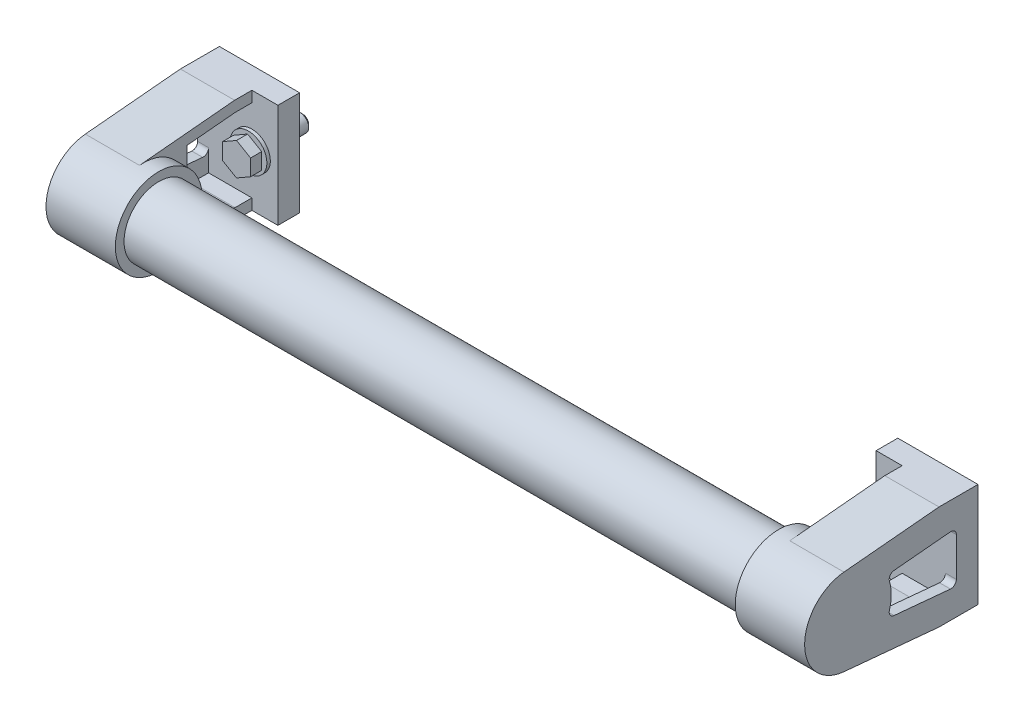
ISO-10303-21;
HEADER;
FILE_DESCRIPTION(('STEP AP214'),'2;1');
FILE_NAME('part.step','',(''),(''),'','','');
FILE_SCHEMA(('AUTOMOTIVE_DESIGN { 1 0 10303 214 1 1 1 1 }'));
ENDSEC;
DATA;
#1=APPLICATION_CONTEXT('core data for automotive mechanical design processes');
#2=APPLICATION_PROTOCOL_DEFINITION('international standard','automotive_design',2000,#1);
#3=PRODUCT_CONTEXT('',#1,'mechanical');
#4=PRODUCT('Part','Part','',(#3));
#5=PRODUCT_RELATED_PRODUCT_CATEGORY('part','',(#4));
#6=PRODUCT_DEFINITION_FORMATION('','',#4);
#7=PRODUCT_DEFINITION_CONTEXT('part definition',#1,'design');
#8=PRODUCT_DEFINITION('design','',#6,#7);
#9=PRODUCT_DEFINITION_SHAPE('','',#8);
#10=(LENGTH_UNIT() NAMED_UNIT(*) SI_UNIT(.MILLI.,.METRE.));
#11=(NAMED_UNIT(*) PLANE_ANGLE_UNIT() SI_UNIT($,.RADIAN.));
#12=(NAMED_UNIT(*) SI_UNIT($,.STERADIAN.) SOLID_ANGLE_UNIT());
#13=UNCERTAINTY_MEASURE_WITH_UNIT(LENGTH_MEASURE(1.E-05),#10,'distance_accuracy_value','');
#14=(GEOMETRIC_REPRESENTATION_CONTEXT(3) GLOBAL_UNCERTAINTY_ASSIGNED_CONTEXT((#13)) GLOBAL_UNIT_ASSIGNED_CONTEXT((#10,
#11,#12)) REPRESENTATION_CONTEXT('',''));
#15=CARTESIAN_POINT('',(0.,0.,0.));
#16=DIRECTION('',(0.,0.,1.));
#17=DIRECTION('',(1.,0.,0.));
#18=AXIS2_PLACEMENT_3D('',#15,#16,#17);
#19=CARTESIAN_POINT('',(293.,2.62463661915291E-12,60.));
#20=DIRECTION('',(-1.,0.,0.));
#21=DIRECTION('',(0.,0.,1.));
#22=AXIS2_PLACEMENT_3D('',#19,#20,#21);
#23=CYLINDRICAL_SURFACE('',#22,16.);
#24=CARTESIAN_POINT('',(293.,2.62463661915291E-12,60.));
#25=DIRECTION('',(1.,0.,0.));
#26=DIRECTION('',(0.,0.,-1.));
#27=AXIS2_PLACEMENT_3D('',#24,#25,#26);
#28=CIRCLE('',#27,16.);
#29=CARTESIAN_POINT('',(293.,2.62463661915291E-12,44.));
#30=VERTEX_POINT('',#29);
#31=EDGE_CURVE('E9',#30,#30,#28,.T.);
#32=ORIENTED_EDGE('',*,*,#31,.F.);
#33=EDGE_LOOP('',(#32));
#34=FACE_BOUND('',#33,.T.);
#35=CARTESIAN_POINT('',(7.,2.62463661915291E-12,60.));
#36=DIRECTION('',(1.,0.,0.));
#37=DIRECTION('',(0.,0.,-1.));
#38=AXIS2_PLACEMENT_3D('',#35,#36,#37);
#39=CIRCLE('',#38,16.);
#40=CARTESIAN_POINT('',(7.,2.62463661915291E-12,44.));
#41=VERTEX_POINT('',#40);
#42=EDGE_CURVE('E24',#41,#41,#39,.T.);
#43=ORIENTED_EDGE('',*,*,#42,.T.);
#44=EDGE_LOOP('',(#43));
#45=FACE_BOUND('',#44,.T.);
#46=ADVANCED_FACE('F14',(#34,#45),#23,.T.);
#47=CARTESIAN_POINT('',(0.,7.21644966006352E-13,17.1));
#48=DIRECTION('',(0.,0.,1.));
#49=DIRECTION('',(0.,-1.,0.));
#50=AXIS2_PLACEMENT_3D('',#47,#48,#49);
#51=PLANE('',#50);
#52=DIRECTION('',(-0.866025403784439,0.5,0.));
#53=VECTOR('',#52,1.);
#54=CARTESIAN_POINT('',(6.5,3.75277674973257,17.1));
#55=LINE('',#54,#53);
#56=CARTESIAN_POINT('',(6.5,3.75277674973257,17.1));
#57=VERTEX_POINT('',#56);
#58=CARTESIAN_POINT('',(0.,7.50555349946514,17.1));
#59=VERTEX_POINT('',#58);
#60=EDGE_CURVE('E534',#57,#59,#55,.T.);
#61=ORIENTED_EDGE('',*,*,#60,.T.);
#62=DIRECTION('',(-0.866025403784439,-0.5,0.));
#63=VECTOR('',#62,1.);
#64=CARTESIAN_POINT('',(0.,7.50555349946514,17.1));
#65=LINE('',#64,#63);
#66=CARTESIAN_POINT('',(-6.5,3.75277674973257,17.1));
#67=VERTEX_POINT('',#66);
#68=EDGE_CURVE('E538',#59,#67,#65,.T.);
#69=ORIENTED_EDGE('',*,*,#68,.T.);
#70=DIRECTION('',(0.,-1.,0.));
#71=VECTOR('',#70,1.);
#72=CARTESIAN_POINT('',(-6.5,3.75277674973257,17.1));
#73=LINE('',#72,#71);
#74=CARTESIAN_POINT('',(-6.5,-3.75277674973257,17.1));
#75=VERTEX_POINT('',#74);
#76=EDGE_CURVE('E545',#67,#75,#73,.T.);
#77=ORIENTED_EDGE('',*,*,#76,.T.);
#78=DIRECTION('',(0.866025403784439,-0.5,0.));
#79=VECTOR('',#78,1.);
#80=CARTESIAN_POINT('',(-6.5,-3.75277674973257,17.1));
#81=LINE('',#80,#79);
#82=CARTESIAN_POINT('',(0.,-7.50555349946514,17.1));
#83=VERTEX_POINT('',#82);
#84=EDGE_CURVE('E553',#75,#83,#81,.T.);
#85=ORIENTED_EDGE('',*,*,#84,.T.);
#86=DIRECTION('',(0.866025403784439,0.5,0.));
#87=VECTOR('',#86,1.);
#88=CARTESIAN_POINT('',(0.,-7.50555349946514,17.1));
#89=LINE('',#88,#87);
#90=CARTESIAN_POINT('',(6.5,-3.75277674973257,17.1));
#91=VERTEX_POINT('',#90);
#92=EDGE_CURVE('E556',#83,#91,#89,.T.);
#93=ORIENTED_EDGE('',*,*,#92,.T.);
#94=DIRECTION('',(0.,1.,0.));
#95=VECTOR('',#94,1.);
#96=CARTESIAN_POINT('',(6.5,-3.75277674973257,17.1));
#97=LINE('',#96,#95);
#98=EDGE_CURVE('E559',#91,#57,#97,.T.);
#99=ORIENTED_EDGE('',*,*,#98,.T.);
#100=EDGE_LOOP('',(#61,#69,#77,#85,#93,#99));
#101=FACE_BOUND('',#100,.T.);
#102=ADVANCED_FACE('F1110',(#101),#51,.T.);
#103=CARTESIAN_POINT('',(6.5,-3.75277674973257,12.));
#104=DIRECTION('',(1.,0.,0.));
#105=DIRECTION('',(0.,0.,-1.));
#106=AXIS2_PLACEMENT_3D('',#103,#104,#105);
#107=PLANE('',#106);
#108=DIRECTION('',(0.,1.,0.));
#109=VECTOR('',#108,1.);
#110=CARTESIAN_POINT('',(6.5,-3.75277674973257,12.));
#111=LINE('',#110,#109);
#112=CARTESIAN_POINT('',(6.5,-3.75277674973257,12.));
#113=VERTEX_POINT('',#112);
#114=CARTESIAN_POINT('',(6.5,3.75277674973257,12.));
#115=VERTEX_POINT('',#114);
#116=EDGE_CURVE('E548',#113,#115,#111,.T.);
#117=ORIENTED_EDGE('',*,*,#116,.T.);
#118=DIRECTION('',(0.,0.,1.));
#119=VECTOR('',#118,1.);
#120=CARTESIAN_POINT('',(6.5,3.75277674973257,12.));
#121=LINE('',#120,#119);
#122=EDGE_CURVE('E562',#115,#57,#121,.T.);
#123=ORIENTED_EDGE('',*,*,#122,.T.);
#124=ORIENTED_EDGE('',*,*,#98,.F.);
#125=DIRECTION('',(0.,0.,1.));
#126=VECTOR('',#125,1.);
#127=CARTESIAN_POINT('',(6.5,-3.75277674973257,12.));
#128=LINE('',#127,#126);
#129=EDGE_CURVE('E566',#113,#91,#128,.T.);
#130=ORIENTED_EDGE('',*,*,#129,.F.);
#131=EDGE_LOOP('',(#117,#123,#124,#130));
#132=FACE_BOUND('',#131,.T.);
#133=ADVANCED_FACE('F1118',(#132),#107,.T.);
#134=CARTESIAN_POINT('',(6.5,3.75277674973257,12.));
#135=DIRECTION('',(0.5,0.866025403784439,0.));
#136=DIRECTION('',(-0.866025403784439,0.5,0.));
#137=AXIS2_PLACEMENT_3D('',#134,#135,#136);
#138=PLANE('',#137);
#139=ORIENTED_EDGE('',*,*,#60,.F.);
#140=ORIENTED_EDGE('',*,*,#122,.F.);
#141=DIRECTION('',(-0.866025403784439,0.5,0.));
#142=VECTOR('',#141,1.);
#143=CARTESIAN_POINT('',(6.5,3.75277674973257,12.));
#144=LINE('',#143,#142);
#145=CARTESIAN_POINT('',(0.,7.50555349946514,12.));
#146=VERTEX_POINT('',#145);
#147=EDGE_CURVE('E561',#115,#146,#144,.T.);
#148=ORIENTED_EDGE('',*,*,#147,.T.);
#149=DIRECTION('',(0.,0.,1.));
#150=VECTOR('',#149,1.);
#151=CARTESIAN_POINT('',(0.,7.50555349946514,12.));
#152=LINE('',#151,#150);
#153=EDGE_CURVE('E578',#146,#59,#152,.T.);
#154=ORIENTED_EDGE('',*,*,#153,.T.);
#155=EDGE_LOOP('',(#139,#140,#148,#154));
#156=FACE_BOUND('',#155,.T.);
#157=ADVANCED_FACE('F1175',(#156),#138,.T.);
#158=CARTESIAN_POINT('',(0.,7.50555349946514,12.));
#159=DIRECTION('',(-0.5,0.866025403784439,0.));
#160=DIRECTION('',(-0.866025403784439,-0.5,0.));
#161=AXIS2_PLACEMENT_3D('',#158,#159,#160);
#162=PLANE('',#161);
#163=ORIENTED_EDGE('',*,*,#68,.F.);
#164=ORIENTED_EDGE('',*,*,#153,.F.);
#165=DIRECTION('',(-0.866025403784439,-0.5,0.));
#166=VECTOR('',#165,1.);
#167=CARTESIAN_POINT('',(0.,7.50555349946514,12.));
#168=LINE('',#167,#166);
#169=CARTESIAN_POINT('',(-6.5,3.75277674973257,12.));
#170=VERTEX_POINT('',#169);
#171=EDGE_CURVE('E1217',#146,#170,#168,.T.);
#172=ORIENTED_EDGE('',*,*,#171,.T.);
#173=DIRECTION('',(0.,0.,1.));
#174=VECTOR('',#173,1.);
#175=CARTESIAN_POINT('',(-6.5,3.75277674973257,12.));
#176=LINE('',#175,#174);
#177=EDGE_CURVE('E575',#170,#67,#176,.T.);
#178=ORIENTED_EDGE('',*,*,#177,.T.);
#179=EDGE_LOOP('',(#163,#164,#172,#178));
#180=FACE_BOUND('',#179,.T.);
#181=ADVANCED_FACE('F1120',(#180),#162,.T.);
#182=CARTESIAN_POINT('',(-6.5,3.75277674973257,12.));
#183=DIRECTION('',(-1.,0.,0.));
#184=DIRECTION('',(0.,0.,1.));
#185=AXIS2_PLACEMENT_3D('',#182,#183,#184);
#186=PLANE('',#185);
#187=DIRECTION('',(0.,-1.,0.));
#188=VECTOR('',#187,1.);
#189=CARTESIAN_POINT('',(-6.5,3.75277674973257,12.));
#190=LINE('',#189,#188);
#191=CARTESIAN_POINT('',(-6.5,-3.75277674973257,12.));
#192=VERTEX_POINT('',#191);
#193=EDGE_CURVE('E1219',#170,#192,#190,.T.);
#194=ORIENTED_EDGE('',*,*,#193,.T.);
#195=DIRECTION('',(0.,0.,1.));
#196=VECTOR('',#195,1.);
#197=CARTESIAN_POINT('',(-6.5,-3.75277674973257,12.));
#198=LINE('',#197,#196);
#199=EDGE_CURVE('E572',#192,#75,#198,.T.);
#200=ORIENTED_EDGE('',*,*,#199,.T.);
#201=ORIENTED_EDGE('',*,*,#76,.F.);
#202=ORIENTED_EDGE('',*,*,#177,.F.);
#203=EDGE_LOOP('',(#194,#200,#201,#202));
#204=FACE_BOUND('',#203,.T.);
#205=ADVANCED_FACE('F1182',(#204),#186,.T.);
#206=CARTESIAN_POINT('',(-6.5,-3.75277674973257,12.));
#207=DIRECTION('',(-0.5,-0.866025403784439,0.));
#208=DIRECTION('',(0.866025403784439,-0.5,0.));
#209=AXIS2_PLACEMENT_3D('',#206,#207,#208);
#210=PLANE('',#209);
#211=DIRECTION('',(0.866025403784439,-0.5,0.));
#212=VECTOR('',#211,1.);
#213=CARTESIAN_POINT('',(-6.5,-3.75277674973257,12.));
#214=LINE('',#213,#212);
#215=CARTESIAN_POINT('',(0.,-7.50555349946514,12.));
#216=VERTEX_POINT('',#215);
#217=EDGE_CURVE('E1225',#192,#216,#214,.T.);
#218=ORIENTED_EDGE('',*,*,#217,.T.);
#219=DIRECTION('',(0.,0.,1.));
#220=VECTOR('',#219,1.);
#221=CARTESIAN_POINT('',(0.,-7.50555349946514,12.));
#222=LINE('',#221,#220);
#223=EDGE_CURVE('E569',#216,#83,#222,.T.);
#224=ORIENTED_EDGE('',*,*,#223,.T.);
#225=ORIENTED_EDGE('',*,*,#84,.F.);
#226=ORIENTED_EDGE('',*,*,#199,.F.);
#227=EDGE_LOOP('',(#218,#224,#225,#226));
#228=FACE_BOUND('',#227,.T.);
#229=ADVANCED_FACE('F1186',(#228),#210,.T.);
#230=CARTESIAN_POINT('',(0.,-7.50555349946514,12.));
#231=DIRECTION('',(0.5,-0.866025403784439,0.));
#232=DIRECTION('',(0.866025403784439,0.5,0.));
#233=AXIS2_PLACEMENT_3D('',#230,#231,#232);
#234=PLANE('',#233);
#235=DIRECTION('',(0.866025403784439,0.5,0.));
#236=VECTOR('',#235,1.);
#237=CARTESIAN_POINT('',(0.,-7.50555349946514,12.));
#238=LINE('',#237,#236);
#239=EDGE_CURVE('E1211',#216,#113,#238,.T.);
#240=ORIENTED_EDGE('',*,*,#239,.T.);
#241=ORIENTED_EDGE('',*,*,#129,.T.);
#242=ORIENTED_EDGE('',*,*,#92,.F.);
#243=ORIENTED_EDGE('',*,*,#223,.F.);
#244=EDGE_LOOP('',(#240,#241,#242,#243));
#245=FACE_BOUND('',#244,.T.);
#246=ADVANCED_FACE('F1190',(#245),#234,.T.);
#247=CARTESIAN_POINT('',(-6.5,4.9960036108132E-13,12.));
#248=DIRECTION('',(0.,0.,-1.));
#249=DIRECTION('',(0.,1.,0.));
#250=AXIS2_PLACEMENT_3D('',#247,#248,#249);
#251=PLANE('',#250);
#252=CARTESIAN_POINT('',(0.,4.99600361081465E-13,12.));
#253=DIRECTION('',(0.,0.,1.));
#254=DIRECTION('',(0.,-1.,0.));
#255=AXIS2_PLACEMENT_3D('',#252,#253,#254);
#256=CIRCLE('',#255,5.85000000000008);
#257=CARTESIAN_POINT('',(0.,-5.84999999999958,12.0000000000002));
#258=VERTEX_POINT('',#257);
#259=EDGE_CURVE('E565',#258,#258,#256,.F.);
#260=ORIENTED_EDGE('',*,*,#259,.F.);
#261=EDGE_LOOP('',(#260));
#262=FACE_BOUND('',#261,.T.);
#263=ORIENTED_EDGE('',*,*,#239,.F.);
#264=ORIENTED_EDGE('',*,*,#217,.F.);
#265=ORIENTED_EDGE('',*,*,#193,.F.);
#266=ORIENTED_EDGE('',*,*,#171,.F.);
#267=ORIENTED_EDGE('',*,*,#147,.F.);
#268=ORIENTED_EDGE('',*,*,#116,.F.);
#269=EDGE_LOOP('',(#263,#264,#265,#266,#267,#268));
#270=FACE_BOUND('',#269,.T.);
#271=ADVANCED_FACE('F1179',(#262,#270),#251,.T.);
#272=CARTESIAN_POINT('',(0.,-5.55111512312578E-13,-13.4));
#273=DIRECTION('',(0.,0.,1.));
#274=DIRECTION('',(0.,-1.,0.));
#275=AXIS2_PLACEMENT_3D('',#272,#273,#274);
#276=PLANE('',#275);
#277=CARTESIAN_POINT('',(0.,-5.6060437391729E-13,-13.4));
#278=DIRECTION('',(0.,0.,1.));
#279=DIRECTION('',(0.,-1.,0.));
#280=AXIS2_PLACEMENT_3D('',#277,#278,#279);
#281=CIRCLE('',#280,2.79999999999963);
#282=CARTESIAN_POINT('',(0.,-2.80000000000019,-13.3999999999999));
#283=VERTEX_POINT('',#282);
#284=EDGE_CURVE('E886',#283,#283,#281,.F.);
#285=ORIENTED_EDGE('',*,*,#284,.T.);
#286=EDGE_LOOP('',(#285));
#287=FACE_BOUND('',#286,.T.);
#288=ADVANCED_FACE('F1108',(#287),#276,.F.);
#289=CARTESIAN_POINT('',(0.,3.33066907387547E-12,80.));
#290=DIRECTION('',(0.,0.,1.));
#291=DIRECTION('',(0.,-1.,0.));
#292=AXIS2_PLACEMENT_3D('',#289,#290,#291);
#293=CYLINDRICAL_SURFACE('',#292,5.85000000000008);
#294=ORIENTED_EDGE('',*,*,#259,.T.);
#295=EDGE_LOOP('',(#294));
#296=FACE_BOUND('',#295,.T.);
#297=CARTESIAN_POINT('',(0.,4.82947015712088E-13,11.6));
#298=DIRECTION('',(0.,0.,1.));
#299=DIRECTION('',(0.,-1.,0.));
#300=AXIS2_PLACEMENT_3D('',#297,#298,#299);
#301=CIRCLE('',#300,5.85000000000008);
#302=CARTESIAN_POINT('',(0.,-5.8499999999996,11.6000000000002));
#303=VERTEX_POINT('',#302);
#304=EDGE_CURVE('E879',#303,#303,#301,.F.);
#305=ORIENTED_EDGE('',*,*,#304,.F.);
#306=EDGE_LOOP('',(#305));
#307=FACE_BOUND('',#306,.T.);
#308=ADVANCED_FACE('F1105',(#296,#307),#293,.T.);
#309=CARTESIAN_POINT('',(0.,-5.10644337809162E-13,-12.2));
#310=DIRECTION('',(0.,0.,1.));
#311=DIRECTION('',(0.,-1.,0.));
#312=AXIS2_PLACEMENT_3D('',#309,#310,#311);
#313=CONICAL_SURFACE('',#312,3.99999999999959,0.785398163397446);
#314=ORIENTED_EDGE('',*,*,#284,.F.);
#315=EDGE_LOOP('',(#314));
#316=FACE_BOUND('',#315,.T.);
#317=CARTESIAN_POINT('',(0.,-5.10644337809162E-13,-12.2));
#318=DIRECTION('',(0.,0.,1.));
#319=DIRECTION('',(0.,-1.,0.));
#320=AXIS2_PLACEMENT_3D('',#317,#318,#319);
#321=CIRCLE('',#320,3.99999999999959);
#322=CARTESIAN_POINT('',(0.,-4.0000000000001,-12.1999999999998));
#323=VERTEX_POINT('',#322);
#324=EDGE_CURVE('E850',#323,#323,#321,.T.);
#325=ORIENTED_EDGE('',*,*,#324,.F.);
#326=EDGE_LOOP('',(#325));
#327=FACE_BOUND('',#326,.T.);
#328=ADVANCED_FACE('F1090',(#316,#327),#313,.T.);
#329=CARTESIAN_POINT('',(-5.85,4.71844785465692E-13,11.6));
#330=DIRECTION('',(0.,0.,1.));
#331=DIRECTION('',(0.,-1.,0.));
#332=AXIS2_PLACEMENT_3D('',#329,#330,#331);
#333=PLANE('',#332);
#334=CARTESIAN_POINT('',(0.,4.82947015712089E-13,11.6));
#335=DIRECTION('',(0.,0.,1.));
#336=DIRECTION('',(0.,-1.,0.));
#337=AXIS2_PLACEMENT_3D('',#334,#335,#336);
#338=CIRCLE('',#337,8.50000000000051);
#339=CARTESIAN_POINT('',(0.,-8.50000000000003,11.6000000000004));
#340=VERTEX_POINT('',#339);
#341=EDGE_CURVE('E826',#340,#340,#338,.F.);
#342=ORIENTED_EDGE('',*,*,#341,.F.);
#343=EDGE_LOOP('',(#342));
#344=FACE_BOUND('',#343,.T.);
#345=ORIENTED_EDGE('',*,*,#304,.T.);
#346=EDGE_LOOP('',(#345));
#347=FACE_BOUND('',#346,.T.);
#348=ADVANCED_FACE('F1104',(#344,#347),#333,.T.);
#349=CARTESIAN_POINT('',(0.,5.27355936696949E-13,12.7319341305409));
#350=DIRECTION('',(0.,0.,1.));
#351=DIRECTION('',(0.,-1.,0.));
#352=AXIS2_PLACEMENT_3D('',#349,#350,#351);
#353=CYLINDRICAL_SURFACE('',#352,3.99999999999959);
#354=ORIENTED_EDGE('',*,*,#324,.T.);
#355=EDGE_LOOP('',(#354));
#356=FACE_BOUND('',#355,.T.);
#357=CARTESIAN_POINT('',(0.,0.,0.));
#358=DIRECTION('',(0.,0.,1.));
#359=DIRECTION('',(0.,-1.,0.));
#360=AXIS2_PLACEMENT_3D('',#357,#358,#359);
#361=CIRCLE('',#360,3.99999999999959);
#362=CARTESIAN_POINT('',(0.,-3.99999999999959,1.1102230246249E-13));
#363=VERTEX_POINT('',#362);
#364=EDGE_CURVE('E721',#363,#363,#361,.T.);
#365=ORIENTED_EDGE('',*,*,#364,.F.);
#366=EDGE_LOOP('',(#365));
#367=FACE_BOUND('',#366,.T.);
#368=ADVANCED_FACE('F1402',(#356,#367),#353,.T.);
#369=CARTESIAN_POINT('',(0.,3.33066907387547E-12,80.));
#370=DIRECTION('',(0.,0.,1.));
#371=DIRECTION('',(0.,-1.,0.));
#372=AXIS2_PLACEMENT_3D('',#369,#370,#371);
#373=CYLINDRICAL_SURFACE('',#372,8.50000000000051);
#374=ORIENTED_EDGE('',*,*,#341,.T.);
#375=EDGE_LOOP('',(#374));
#376=FACE_BOUND('',#375,.T.);
#377=CARTESIAN_POINT('',(0.,4.16333634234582E-13,10.));
#378=DIRECTION('',(0.,0.,1.));
#379=DIRECTION('',(0.,-1.,0.));
#380=AXIS2_PLACEMENT_3D('',#377,#378,#379);
#381=CIRCLE('',#380,8.50000000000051);
#382=CARTESIAN_POINT('',(0.,-8.50000000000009,10.0000000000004));
#383=VERTEX_POINT('',#382);
#384=EDGE_CURVE('E687',#383,#383,#381,.T.);
#385=ORIENTED_EDGE('',*,*,#384,.T.);
#386=EDGE_LOOP('',(#385));
#387=FACE_BOUND('',#386,.T.);
#388=ADVANCED_FACE('F1397',(#376,#387),#373,.T.);
#389=CARTESIAN_POINT('',(-20.,-18.9999999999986,40.0000000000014));
#390=DIRECTION('',(1.,0.,0.));
#391=DIRECTION('',(0.,0.,-1.));
#392=AXIS2_PLACEMENT_3D('',#389,#390,#391);
#393=PLANE('',#392);
#394=DIRECTION('',(0.,1.,0.));
#395=VECTOR('',#394,1.);
#396=CARTESIAN_POINT('',(-20.,-8.94532766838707,10.0000000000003));
#397=LINE('',#396,#395);
#398=CARTESIAN_POINT('',(-20.,8.94532766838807,9.99999999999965));
#399=VERTEX_POINT('',#398);
#400=CARTESIAN_POINT('',(-20.,19.0000000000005,9.99999999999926));
#401=VERTEX_POINT('',#400);
#402=EDGE_CURVE('E684',#399,#401,#397,.T.);
#403=ORIENTED_EDGE('',*,*,#402,.T.);
#404=DIRECTION('',(0.,0.,-1.));
#405=VECTOR('',#404,1.);
#406=CARTESIAN_POINT('',(-20.,19.0000000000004,9.99999999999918));
#407=LINE('',#406,#405);
#408=CARTESIAN_POINT('',(-20.,19.0000000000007,17.7675646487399));
#409=VERTEX_POINT('',#408);
#410=EDGE_CURVE('E759',#409,#401,#407,.T.);
#411=ORIENTED_EDGE('',*,*,#410,.F.);
#412=DIRECTION('',(0.,0.0927736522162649,-0.995687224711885));
#413=VECTOR('',#412,1.);
#414=CARTESIAN_POINT('',(-20.,19.0000000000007,17.7675646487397));
#415=LINE('',#414,#413);
#416=CARTESIAN_POINT('',(-20.,16.9284817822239,40.));
#417=VERTEX_POINT('',#416);
#418=EDGE_CURVE('E760',#417,#409,#415,.T.);
#419=ORIENTED_EDGE('',*,*,#418,.F.);
#420=DIRECTION('',(0.,1.,0.));
#421=VECTOR('',#420,1.);
#422=CARTESIAN_POINT('',(-20.,-23.9999999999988,40.0000000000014));
#423=LINE('',#422,#421);
#424=CARTESIAN_POINT('',(-20.,8.50076165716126,40.));
#425=VERTEX_POINT('',#424);
#426=EDGE_CURVE('E770',#425,#417,#423,.T.);
#427=ORIENTED_EDGE('',*,*,#426,.F.);
#428=CARTESIAN_POINT('',(-20.,6.52582549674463,38.4671506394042));
#429=DIRECTION('',(-1.,0.,0.));
#430=DIRECTION('',(0.,0.,1.));
#431=AXIS2_PLACEMENT_3D('',#428,#429,#430);
#432=CIRCLE('',#431,2.5);
#433=CARTESIAN_POINT('',(-20.,9.01504355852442,38.699084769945));
#434=VERTEX_POINT('',#433);
#435=EDGE_CURVE('E698',#425,#434,#432,.T.);
#436=ORIENTED_EDGE('',*,*,#435,.T.);
#437=DIRECTION('',(0.,-0.0927736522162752,0.995687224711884));
#438=VECTOR('',#437,1.);
#439=CARTESIAN_POINT('',(-20.,11.4345457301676,12.7319341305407));
#440=LINE('',#439,#438);
#441=CARTESIAN_POINT('',(-20.,11.4345457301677,12.7319341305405));
#442=VERTEX_POINT('',#441);
#443=EDGE_CURVE('E702',#434,#442,#440,.F.);
#444=ORIENTED_EDGE('',*,*,#443,.T.);
#445=CARTESIAN_POINT('',(-20.,8.94532766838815,12.4999999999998));
#446=DIRECTION('',(-1.,0.,0.));
#447=DIRECTION('',(0.,0.,1.));
#448=AXIS2_PLACEMENT_3D('',#445,#446,#447);
#449=CIRCLE('',#448,2.5);
#450=EDGE_CURVE('E720',#442,#399,#449,.T.);
#451=ORIENTED_EDGE('',*,*,#450,.T.);
#452=EDGE_LOOP('',(#403,#411,#419,#427,#436,#444,#451));
#453=FACE_BOUND('',#452,.T.);
#454=ADVANCED_FACE('F1349',(#453),#393,.T.);
#455=CARTESIAN_POINT('',(-20.,-18.9999999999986,40.0000000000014));
#456=DIRECTION('',(1.,0.,0.));
#457=DIRECTION('',(0.,0.,-1.));
#458=AXIS2_PLACEMENT_3D('',#455,#456,#457);
#459=PLANE('',#458);
#460=DIRECTION('',(0.,1.,0.));
#461=VECTOR('',#460,1.);
#462=CARTESIAN_POINT('',(-20.,-23.9999999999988,40.0000000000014));
#463=LINE('',#462,#461);
#464=CARTESIAN_POINT('',(-20.,-16.9284817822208,40.0000000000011));
#465=VERTEX_POINT('',#464);
#466=CARTESIAN_POINT('',(-20.,-8.50076165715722,40.0000000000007));
#467=VERTEX_POINT('',#466);
#468=EDGE_CURVE('E791',#465,#467,#463,.T.);
#469=ORIENTED_EDGE('',*,*,#468,.F.);
#470=DIRECTION('',(0.,-0.0927736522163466,-0.995687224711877));
#471=VECTOR('',#470,1.);
#472=CARTESIAN_POINT('',(-20.,-18.9999999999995,17.7675646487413));
#473=LINE('',#472,#471);
#474=CARTESIAN_POINT('',(-20.,-18.9999999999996,17.7675646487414));
#475=VERTEX_POINT('',#474);
#476=EDGE_CURVE('E801',#465,#475,#473,.T.);
#477=ORIENTED_EDGE('',*,*,#476,.T.);
#478=DIRECTION('',(0.,0.,-1.));
#479=VECTOR('',#478,1.);
#480=CARTESIAN_POINT('',(-20.,-19.,10.0000000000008));
#481=LINE('',#480,#479);
#482=CARTESIAN_POINT('',(-20.,-19.,10.0000000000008));
#483=VERTEX_POINT('',#482);
#484=EDGE_CURVE('E823',#475,#483,#481,.T.);
#485=ORIENTED_EDGE('',*,*,#484,.T.);
#486=DIRECTION('',(0.,1.,0.));
#487=VECTOR('',#486,1.);
#488=CARTESIAN_POINT('',(-20.,-8.94532766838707,10.0000000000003));
#489=LINE('',#488,#487);
#490=CARTESIAN_POINT('',(-20.,-8.94532766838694,10.0000000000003));
#491=VERTEX_POINT('',#490);
#492=EDGE_CURVE('E681',#483,#491,#489,.T.);
#493=ORIENTED_EDGE('',*,*,#492,.T.);
#494=CARTESIAN_POINT('',(-20.,-8.94532766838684,12.5000000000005));
#495=DIRECTION('',(-1.,0.,0.));
#496=DIRECTION('',(0.,0.,1.));
#497=AXIS2_PLACEMENT_3D('',#494,#495,#496);
#498=CIRCLE('',#497,2.5);
#499=CARTESIAN_POINT('',(-20.,-11.4345457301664,12.7319341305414));
#500=VERTEX_POINT('',#499);
#501=EDGE_CURVE('E688',#491,#500,#498,.T.);
#502=ORIENTED_EDGE('',*,*,#501,.T.);
#503=DIRECTION('',(0.,0.0927736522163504,0.995687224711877));
#504=VECTOR('',#503,1.);
#505=CARTESIAN_POINT('',(-20.,-11.4345457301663,12.7319341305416));
#506=LINE('',#505,#504);
#507=CARTESIAN_POINT('',(-20.,-9.01504355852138,38.6990847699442));
#508=VERTEX_POINT('',#507);
#509=EDGE_CURVE('E692',#508,#500,#506,.F.);
#510=ORIENTED_EDGE('',*,*,#509,.F.);
#511=CARTESIAN_POINT('',(-20.,-6.52582549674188,38.4671506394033));
#512=DIRECTION('',(-1.,0.,0.));
#513=DIRECTION('',(0.,0.,1.));
#514=AXIS2_PLACEMENT_3D('',#511,#512,#513);
#515=CIRCLE('',#514,2.5);
#516=EDGE_CURVE('E697',#508,#467,#515,.T.);
#517=ORIENTED_EDGE('',*,*,#516,.T.);
#518=EDGE_LOOP('',(#469,#477,#485,#493,#502,#510,#517));
#519=FACE_BOUND('',#518,.T.);
#520=ADVANCED_FACE('F1292',(#519),#459,.T.);
#521=CARTESIAN_POINT('',(12.,-24.,10.0000000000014));
#522=DIRECTION('',(1.,0.,0.));
#523=DIRECTION('',(0.,0.,-1.));
#524=AXIS2_PLACEMENT_3D('',#521,#522,#523);
#525=PLANE('',#524);
#526=DIRECTION('',(0.,1.,0.));
#527=VECTOR('',#526,1.);
#528=CARTESIAN_POINT('',(12.,-24.0000000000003,9.43689570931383E-13));
#529=LINE('',#528,#527);
#530=CARTESIAN_POINT('',(12.,24.,-1.0177044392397E-12));
#531=VERTEX_POINT('',#530);
#532=CARTESIAN_POINT('',(12.,-24.0000000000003,9.43689570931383E-13));
#533=VERTEX_POINT('',#532);
#534=EDGE_CURVE('E717',#531,#533,#529,.F.);
#535=ORIENTED_EDGE('',*,*,#534,.F.);
#536=DIRECTION('',(0.,0.,1.));
#537=VECTOR('',#536,1.);
#538=CARTESIAN_POINT('',(12.,24.,-1.0547118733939E-12));
#539=LINE('',#538,#537);
#540=CARTESIAN_POINT('',(12.,24.0000000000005,9.99999999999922));
#541=VERTEX_POINT('',#540);
#542=EDGE_CURVE('E705',#541,#531,#539,.F.);
#543=ORIENTED_EDGE('',*,*,#542,.F.);
#544=DIRECTION('',(0.,1.,0.));
#545=VECTOR('',#544,1.);
#546=CARTESIAN_POINT('',(12.,-8.94532766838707,10.0000000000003));
#547=LINE('',#546,#545);
#548=CARTESIAN_POINT('',(12.,-24.,10.0000000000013));
#549=VERTEX_POINT('',#548);
#550=EDGE_CURVE('E732',#541,#549,#547,.F.);
#551=ORIENTED_EDGE('',*,*,#550,.T.);
#552=DIRECTION('',(0.,0.,1.));
#553=VECTOR('',#552,1.);
#554=CARTESIAN_POINT('',(12.,-24.0000000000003,9.43689570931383E-13));
#555=LINE('',#554,#553);
#556=EDGE_CURVE('E714',#549,#533,#555,.F.);
#557=ORIENTED_EDGE('',*,*,#556,.T.);
#558=EDGE_LOOP('',(#535,#543,#551,#557));
#559=FACE_BOUND('',#558,.T.);
#560=ADVANCED_FACE('F1331',(#559),#525,.T.);
#561=CARTESIAN_POINT('',(-11.,19.0000000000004,9.99999999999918));
#562=DIRECTION('',(0.,-1.,0.));
#563=DIRECTION('',(0.,0.,-1.));
#564=AXIS2_PLACEMENT_3D('',#561,#562,#563);
#565=PLANE('',#564);
#566=DIRECTION('',(1.,0.,0.));
#567=VECTOR('',#566,1.);
#568=CARTESIAN_POINT('',(16.,19.0000000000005,9.99999999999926));
#569=LINE('',#568,#567);
#570=CARTESIAN_POINT('',(0.,19.0000000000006,9.99999999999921));
#571=VERTEX_POINT('',#570);
#572=EDGE_CURVE('E746',#401,#571,#569,.T.);
#573=ORIENTED_EDGE('',*,*,#572,.T.);
#574=DIRECTION('',(0.,0.,-1.));
#575=VECTOR('',#574,1.);
#576=CARTESIAN_POINT('',(0.,19.0000000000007,60.));
#577=LINE('',#576,#575);
#578=CARTESIAN_POINT('',(0.,19.0000000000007,17.7675646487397));
#579=VERTEX_POINT('',#578);
#580=EDGE_CURVE('E741',#579,#571,#577,.T.);
#581=ORIENTED_EDGE('',*,*,#580,.F.);
#582=DIRECTION('',(1.,0.,0.));
#583=VECTOR('',#582,1.);
#584=CARTESIAN_POINT('',(-11.,19.0000000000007,17.7675646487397));
#585=LINE('',#584,#583);
#586=EDGE_CURVE('E756',#579,#409,#585,.F.);
#587=ORIENTED_EDGE('',*,*,#586,.T.);
#588=ORIENTED_EDGE('',*,*,#410,.T.);
#589=EDGE_LOOP('',(#573,#581,#587,#588));
#590=FACE_BOUND('',#589,.T.);
#591=ADVANCED_FACE('F1345',(#590),#565,.T.);
#592=CARTESIAN_POINT('',(-11.,19.0000000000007,17.7675646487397));
#593=DIRECTION('',(0.,-0.995687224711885,-0.0927736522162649));
#594=DIRECTION('',(0.,0.0927736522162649,-0.995687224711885));
#595=AXIS2_PLACEMENT_3D('',#592,#593,#594);
#596=PLANE('',#595);
#597=ORIENTED_EDGE('',*,*,#586,.F.);
#598=DIRECTION('',(0.,0.0927736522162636,-0.995687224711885));
#599=VECTOR('',#598,1.);
#600=CARTESIAN_POINT('',(0.,16.9284817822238,40.));
#601=LINE('',#600,#599);
#602=CARTESIAN_POINT('',(0.,16.9284817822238,40.));
#603=VERTEX_POINT('',#602);
#604=EDGE_CURVE('E635',#603,#579,#601,.T.);
#605=ORIENTED_EDGE('',*,*,#604,.F.);
#606=DIRECTION('',(1.,0.,0.));
#607=VECTOR('',#606,1.);
#608=CARTESIAN_POINT('',(-11.,16.9284817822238,40.));
#609=LINE('',#608,#607);
#610=EDGE_CURVE('E767',#603,#417,#609,.F.);
#611=ORIENTED_EDGE('',*,*,#610,.T.);
#612=ORIENTED_EDGE('',*,*,#418,.T.);
#613=EDGE_LOOP('',(#597,#605,#611,#612));
#614=FACE_BOUND('',#613,.T.);
#615=ADVANCED_FACE('F1377',(#614),#596,.T.);
#616=CARTESIAN_POINT('',(3.99999999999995,-23.9999999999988,40.0000000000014));
#617=DIRECTION('',(0.,0.,-1.));
#618=DIRECTION('',(0.,1.,0.));
#619=AXIS2_PLACEMENT_3D('',#616,#617,#618);
#620=PLANE('',#619);
#621=DIRECTION('',(-1.,0.,0.));
#622=VECTOR('',#621,1.);
#623=CARTESIAN_POINT('',(16.,8.50076165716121,40.));
#624=LINE('',#623,#622);
#625=CARTESIAN_POINT('',(0.,8.50076165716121,40.));
#626=VERTEX_POINT('',#625);
#627=EDGE_CURVE('E701',#626,#425,#624,.T.);
#628=ORIENTED_EDGE('',*,*,#627,.T.);
#629=ORIENTED_EDGE('',*,*,#426,.T.);
#630=ORIENTED_EDGE('',*,*,#610,.F.);
#631=DIRECTION('',(0.,1.,0.));
#632=VECTOR('',#631,1.);
#633=CARTESIAN_POINT('',(0.,2.62290189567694E-12,40.));
#634=LINE('',#633,#632);
#635=EDGE_CURVE('E632',#626,#603,#634,.T.);
#636=ORIENTED_EDGE('',*,*,#635,.F.);
#637=EDGE_LOOP('',(#628,#629,#630,#636));
#638=FACE_BOUND('',#637,.T.);
#639=ADVANCED_FACE('F1375',(#638),#620,.T.);
#640=CARTESIAN_POINT('',(16.,-24.0000000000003,9.43689570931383E-13));
#641=DIRECTION('',(0.,0.,-1.));
#642=DIRECTION('',(0.,1.,0.));
#643=AXIS2_PLACEMENT_3D('',#640,#641,#642);
#644=PLANE('',#643);
#645=DIRECTION('',(1.,0.,0.));
#646=VECTOR('',#645,1.);
#647=CARTESIAN_POINT('',(16.,-24.0000000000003,9.43689570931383E-13));
#648=LINE('',#647,#646);
#649=CARTESIAN_POINT('',(-25.,-24.0000000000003,-3.88578058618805E-13));
#650=VERTEX_POINT('',#649);
#651=EDGE_CURVE('E656',#533,#650,#648,.F.);
#652=ORIENTED_EDGE('',*,*,#651,.T.);
#653=DIRECTION('',(0.,1.,0.));
#654=VECTOR('',#653,1.);
#655=CARTESIAN_POINT('',(-25.,2.62290189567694E-12,-1.0547118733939E-12));
#656=LINE('',#655,#654);
#657=CARTESIAN_POINT('',(-25.,24.0000000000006,-1.0547118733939E-12));
#658=VERTEX_POINT('',#657);
#659=EDGE_CURVE('E612',#658,#650,#656,.F.);
#660=ORIENTED_EDGE('',*,*,#659,.F.);
#661=DIRECTION('',(1.,0.,0.));
#662=VECTOR('',#661,1.);
#663=CARTESIAN_POINT('',(16.,24.,-1.0547118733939E-12));
#664=LINE('',#663,#662);
#665=EDGE_CURVE('E645',#531,#658,#664,.F.);
#666=ORIENTED_EDGE('',*,*,#665,.F.);
#667=ORIENTED_EDGE('',*,*,#534,.T.);
#668=EDGE_LOOP('',(#652,#660,#666,#667));
#669=FACE_BOUND('',#668,.T.);
#670=ORIENTED_EDGE('',*,*,#364,.T.);
#671=EDGE_LOOP('',(#670));
#672=FACE_BOUND('',#671,.T.);
#673=ADVANCED_FACE('F1334',(#669,#672),#644,.T.);
#674=CARTESIAN_POINT('',(16.,24.,-1.0547118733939E-12));
#675=DIRECTION('',(0.,1.,0.));
#676=DIRECTION('',(0.,0.,1.));
#677=AXIS2_PLACEMENT_3D('',#674,#675,#676);
#678=PLANE('',#677);
#679=DIRECTION('',(0.,0.,1.));
#680=VECTOR('',#679,1.);
#681=CARTESIAN_POINT('',(-25.,24.0000000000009,60.));
#682=LINE('',#681,#680);
#683=CARTESIAN_POINT('',(-25.,24.0000000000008,17.999999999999));
#684=VERTEX_POINT('',#683);
#685=EDGE_CURVE('E609',#684,#658,#682,.F.);
#686=ORIENTED_EDGE('',*,*,#685,.F.);
#687=DIRECTION('',(1.,0.,0.));
#688=VECTOR('',#687,1.);
#689=CARTESIAN_POINT('',(16.,24.0000000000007,17.999999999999));
#690=LINE('',#689,#688);
#691=CARTESIAN_POINT('',(0.,24.0000000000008,17.999999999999));
#692=VERTEX_POINT('',#691);
#693=EDGE_CURVE('E592',#692,#684,#690,.F.);
#694=ORIENTED_EDGE('',*,*,#693,.F.);
#695=DIRECTION('',(0.,0.,1.));
#696=VECTOR('',#695,1.);
#697=CARTESIAN_POINT('',(0.,24.,-1.0547118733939E-12));
#698=LINE('',#697,#696);
#699=CARTESIAN_POINT('',(0.,24.0000000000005,9.99999999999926));
#700=VERTEX_POINT('',#699);
#701=EDGE_CURVE('E621',#692,#700,#698,.F.);
#702=ORIENTED_EDGE('',*,*,#701,.T.);
#703=DIRECTION('',(1.,0.,0.));
#704=VECTOR('',#703,1.);
#705=CARTESIAN_POINT('',(16.,24.0000000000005,9.9999999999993));
#706=LINE('',#705,#704);
#707=EDGE_CURVE('E624',#700,#541,#706,.T.);
#708=ORIENTED_EDGE('',*,*,#707,.T.);
#709=ORIENTED_EDGE('',*,*,#542,.T.);
#710=ORIENTED_EDGE('',*,*,#665,.T.);
#711=EDGE_LOOP('',(#686,#694,#702,#708,#709,#710));
#712=FACE_BOUND('',#711,.T.);
#713=ADVANCED_FACE('F1156',(#712),#678,.T.);
#714=CARTESIAN_POINT('',(16.,6.52582549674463,38.4671506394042));
#715=DIRECTION('',(-1.,0.,0.));
#716=DIRECTION('',(0.,0.,1.));
#717=AXIS2_PLACEMENT_3D('',#714,#715,#716);
#718=CYLINDRICAL_SURFACE('',#717,2.5);
#719=CARTESIAN_POINT('',(0.,6.52582549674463,38.4671506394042));
#720=DIRECTION('',(-1.,0.,0.));
#721=DIRECTION('',(0.,0.,1.));
#722=AXIS2_PLACEMENT_3D('',#719,#720,#721);
#723=CIRCLE('',#722,2.5);
#724=CARTESIAN_POINT('',(0.,5.80073377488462,40.8596894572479));
#725=VERTEX_POINT('',#724);
#726=EDGE_CURVE('E625',#725,#626,#723,.T.);
#727=ORIENTED_EDGE('',*,*,#726,.F.);
#728=DIRECTION('',(-1.,0.,0.));
#729=VECTOR('',#728,1.);
#730=CARTESIAN_POINT('',(7.,5.8007337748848,40.8596894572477));
#731=LINE('',#730,#729);
#732=CARTESIAN_POINT('',(-25.,5.80073377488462,40.8596894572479));
#733=VERTEX_POINT('',#732);
#734=EDGE_CURVE('E598',#733,#725,#731,.F.);
#735=ORIENTED_EDGE('',*,*,#734,.F.);
#736=CARTESIAN_POINT('',(-25.,6.52582549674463,38.4671506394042));
#737=DIRECTION('',(-1.,0.,0.));
#738=DIRECTION('',(0.,0.,1.));
#739=AXIS2_PLACEMENT_3D('',#736,#737,#738);
#740=CIRCLE('',#739,2.5);
#741=CARTESIAN_POINT('',(-25.,9.01504355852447,38.699084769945));
#742=VERTEX_POINT('',#741);
#743=EDGE_CURVE('E607',#742,#733,#740,.F.);
#744=ORIENTED_EDGE('',*,*,#743,.F.);
#745=DIRECTION('',(-1.,0.,0.));
#746=VECTOR('',#745,1.);
#747=CARTESIAN_POINT('',(16.,9.01504355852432,38.6990847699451));
#748=LINE('',#747,#746);
#749=EDGE_CURVE('E694',#434,#742,#748,.T.);
#750=ORIENTED_EDGE('',*,*,#749,.F.);
#751=ORIENTED_EDGE('',*,*,#435,.F.);
#752=ORIENTED_EDGE('',*,*,#627,.F.);
#753=EDGE_LOOP('',(#727,#735,#744,#750,#751,#752));
#754=FACE_BOUND('',#753,.T.);
#755=ADVANCED_FACE('F1369',(#754),#718,.F.);
#756=CARTESIAN_POINT('',(7.,11.4345457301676,12.7319341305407));
#757=DIRECTION('',(0.,0.995687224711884,0.0927736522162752));
#758=DIRECTION('',(0.,-0.0927736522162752,0.995687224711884));
#759=AXIS2_PLACEMENT_3D('',#756,#757,#758);
#760=PLANE('',#759);
#761=DIRECTION('',(0.,-0.0927736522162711,0.995687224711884));
#762=VECTOR('',#761,1.);
#763=CARTESIAN_POINT('',(-25.,11.4345457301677,12.7319341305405));
#764=LINE('',#763,#762);
#765=CARTESIAN_POINT('',(-25.,11.4345457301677,12.7319341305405));
#766=VERTEX_POINT('',#765);
#767=EDGE_CURVE('E604',#766,#742,#764,.T.);
#768=ORIENTED_EDGE('',*,*,#767,.F.);
#769=DIRECTION('',(1.,0.,0.));
#770=VECTOR('',#769,1.);
#771=CARTESIAN_POINT('',(7.,11.4345457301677,12.7319341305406));
#772=LINE('',#771,#770);
#773=EDGE_CURVE('E699',#442,#766,#772,.F.);
#774=ORIENTED_EDGE('',*,*,#773,.F.);
#775=ORIENTED_EDGE('',*,*,#443,.F.);
#776=ORIENTED_EDGE('',*,*,#749,.T.);
#777=EDGE_LOOP('',(#768,#774,#775,#776));
#778=FACE_BOUND('',#777,.T.);
#779=ADVANCED_FACE('F1989',(#778),#760,.F.);
#780=CARTESIAN_POINT('',(7.,8.94532766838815,12.4999999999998));
#781=DIRECTION('',(-1.,0.,0.));
#782=DIRECTION('',(0.,0.,1.));
#783=AXIS2_PLACEMENT_3D('',#780,#781,#782);
#784=CYLINDRICAL_SURFACE('',#783,2.5);
#785=ORIENTED_EDGE('',*,*,#773,.T.);
#786=CARTESIAN_POINT('',(-25.,8.94532766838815,12.4999999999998));
#787=DIRECTION('',(-1.,0.,0.));
#788=DIRECTION('',(0.,0.,1.));
#789=AXIS2_PLACEMENT_3D('',#786,#787,#788);
#790=CIRCLE('',#789,2.5);
#791=CARTESIAN_POINT('',(-25.,8.94532766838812,10.));
#792=VERTEX_POINT('',#791);
#793=EDGE_CURVE('E608',#792,#766,#790,.F.);
#794=ORIENTED_EDGE('',*,*,#793,.F.);
#795=DIRECTION('',(1.,0.,0.));
#796=VECTOR('',#795,1.);
#797=CARTESIAN_POINT('',(16.,8.94532766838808,9.99999999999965));
#798=LINE('',#797,#796);
#799=EDGE_CURVE('E680',#792,#399,#798,.T.);
#800=ORIENTED_EDGE('',*,*,#799,.T.);
#801=ORIENTED_EDGE('',*,*,#450,.F.);
#802=EDGE_LOOP('',(#785,#794,#800,#801));
#803=FACE_BOUND('',#802,.T.);
#804=ADVANCED_FACE('F1980',(#803),#784,.F.);
#805=CARTESIAN_POINT('',(7.,-8.94532766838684,12.5000000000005));
#806=DIRECTION('',(-1.,0.,0.));
#807=DIRECTION('',(0.,0.,1.));
#808=AXIS2_PLACEMENT_3D('',#805,#806,#807);
#809=CYLINDRICAL_SURFACE('',#808,2.5);
#810=CARTESIAN_POINT('',(-25.,-8.94532766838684,12.5000000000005));
#811=DIRECTION('',(-1.,0.,0.));
#812=DIRECTION('',(0.,0.,1.));
#813=AXIS2_PLACEMENT_3D('',#810,#811,#812);
#814=CIRCLE('',#813,2.5);
#815=CARTESIAN_POINT('',(-25.,-11.4345457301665,12.7319341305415));
#816=VERTEX_POINT('',#815);
#817=CARTESIAN_POINT('',(-25.,-8.94532766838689,10.0000000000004));
#818=VERTEX_POINT('',#817);
#819=EDGE_CURVE('E599',#816,#818,#814,.F.);
#820=ORIENTED_EDGE('',*,*,#819,.F.);
#821=DIRECTION('',(-1.,0.,0.));
#822=VECTOR('',#821,1.);
#823=CARTESIAN_POINT('',(7.,-11.4345457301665,12.7319341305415));
#824=LINE('',#823,#822);
#825=EDGE_CURVE('E685',#500,#816,#824,.T.);
#826=ORIENTED_EDGE('',*,*,#825,.F.);
#827=ORIENTED_EDGE('',*,*,#501,.F.);
#828=DIRECTION('',(1.,0.,0.));
#829=VECTOR('',#828,1.);
#830=CARTESIAN_POINT('',(16.,-8.94532766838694,10.0000000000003));
#831=LINE('',#830,#829);
#832=EDGE_CURVE('E678',#491,#818,#831,.F.);
#833=ORIENTED_EDGE('',*,*,#832,.T.);
#834=EDGE_LOOP('',(#820,#826,#827,#833));
#835=FACE_BOUND('',#834,.T.);
#836=ADVANCED_FACE('F1307',(#835),#809,.F.);
#837=CARTESIAN_POINT('',(7.,-11.4345457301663,12.7319341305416));
#838=DIRECTION('',(0.,0.995687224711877,-0.0927736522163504));
#839=DIRECTION('',(0.,0.0927736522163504,0.995687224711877));
#840=AXIS2_PLACEMENT_3D('',#837,#838,#839);
#841=PLANE('',#840);
#842=ORIENTED_EDGE('',*,*,#825,.T.);
#843=DIRECTION('',(0.,-0.0927736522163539,-0.995687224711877));
#844=VECTOR('',#843,1.);
#845=CARTESIAN_POINT('',(-25.,-9.01504355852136,38.6990847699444));
#846=LINE('',#845,#844);
#847=CARTESIAN_POINT('',(-25.,-9.01504355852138,38.6990847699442));
#848=VERTEX_POINT('',#847);
#849=EDGE_CURVE('E600',#848,#816,#846,.T.);
#850=ORIENTED_EDGE('',*,*,#849,.F.);
#851=DIRECTION('',(1.,0.,0.));
#852=VECTOR('',#851,1.);
#853=CARTESIAN_POINT('',(7.,-9.01504355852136,38.6990847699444));
#854=LINE('',#853,#852);
#855=EDGE_CURVE('E689',#848,#508,#854,.T.);
#856=ORIENTED_EDGE('',*,*,#855,.T.);
#857=ORIENTED_EDGE('',*,*,#509,.T.);
#858=EDGE_LOOP('',(#842,#850,#856,#857));
#859=FACE_BOUND('',#858,.T.);
#860=ADVANCED_FACE('F1311',(#859),#841,.T.);
#861=CARTESIAN_POINT('',(-11.,-18.9999999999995,17.7675646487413));
#862=DIRECTION('',(0.,-0.995687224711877,0.0927736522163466));
#863=DIRECTION('',(0.,-0.0927736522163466,-0.995687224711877));
#864=AXIS2_PLACEMENT_3D('',#861,#862,#863);
#865=PLANE('',#864);
#866=ORIENTED_EDGE('',*,*,#476,.F.);
#867=DIRECTION('',(1.,0.,0.));
#868=VECTOR('',#867,1.);
#869=CARTESIAN_POINT('',(3.99999999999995,-16.9284817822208,40.0000000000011));
#870=LINE('',#869,#868);
#871=CARTESIAN_POINT('',(0.,-16.9284817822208,40.0000000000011));
#872=VERTEX_POINT('',#871);
#873=EDGE_CURVE('E788',#872,#465,#870,.F.);
#874=ORIENTED_EDGE('',*,*,#873,.F.);
#875=DIRECTION('',(0.,0.0927736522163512,0.995687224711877));
#876=VECTOR('',#875,1.);
#877=CARTESIAN_POINT('',(0.,-18.9999999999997,17.7675646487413));
#878=LINE('',#877,#876);
#879=CARTESIAN_POINT('',(0.,-19.,17.7675646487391));
#880=VERTEX_POINT('',#879);
#881=EDGE_CURVE('E668',#880,#872,#878,.T.);
#882=ORIENTED_EDGE('',*,*,#881,.F.);
#883=DIRECTION('',(1.,0.,0.));
#884=VECTOR('',#883,1.);
#885=CARTESIAN_POINT('',(-11.,-18.9999999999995,17.7675646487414));
#886=LINE('',#885,#884);
#887=EDGE_CURVE('E792',#475,#880,#886,.T.);
#888=ORIENTED_EDGE('',*,*,#887,.F.);
#889=EDGE_LOOP('',(#866,#874,#882,#888));
#890=FACE_BOUND('',#889,.T.);
#891=ADVANCED_FACE('F1322',(#890),#865,.F.);
#892=CARTESIAN_POINT('',(-11.,-19.,10.0000000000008));
#893=DIRECTION('',(0.,-1.,0.));
#894=DIRECTION('',(0.,0.,-1.));
#895=AXIS2_PLACEMENT_3D('',#892,#893,#894);
#896=PLANE('',#895);
#897=ORIENTED_EDGE('',*,*,#484,.F.);
#898=ORIENTED_EDGE('',*,*,#887,.T.);
#899=DIRECTION('',(0.,0.,-1.));
#900=VECTOR('',#899,1.);
#901=CARTESIAN_POINT('',(0.,-19.,38.4671506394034));
#902=LINE('',#901,#900);
#903=CARTESIAN_POINT('',(0.,-19.,10.0000000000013));
#904=VERTEX_POINT('',#903);
#905=EDGE_CURVE('E775',#904,#880,#902,.F.);
#906=ORIENTED_EDGE('',*,*,#905,.F.);
#907=DIRECTION('',(1.,0.,0.));
#908=VECTOR('',#907,1.);
#909=CARTESIAN_POINT('',(16.,-19.,10.0000000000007));
#910=LINE('',#909,#908);
#911=EDGE_CURVE('E735',#904,#483,#910,.F.);
#912=ORIENTED_EDGE('',*,*,#911,.T.);
#913=EDGE_LOOP('',(#897,#898,#906,#912));
#914=FACE_BOUND('',#913,.T.);
#915=ADVANCED_FACE('F1298',(#914),#896,.F.);
#916=CARTESIAN_POINT('',(16.,-8.94532766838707,10.0000000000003));
#917=DIRECTION('',(0.,0.,-1.));
#918=DIRECTION('',(0.,1.,0.));
#919=AXIS2_PLACEMENT_3D('',#916,#917,#918);
#920=PLANE('',#919);
#921=ORIENTED_EDGE('',*,*,#572,.F.);
#922=ORIENTED_EDGE('',*,*,#402,.F.);
#923=ORIENTED_EDGE('',*,*,#799,.F.);
#924=DIRECTION('',(0.,1.,0.));
#925=VECTOR('',#924,1.);
#926=CARTESIAN_POINT('',(-25.,2.62290189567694E-12,10.0000000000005));
#927=LINE('',#926,#925);
#928=EDGE_CURVE('E595',#818,#792,#927,.T.);
#929=ORIENTED_EDGE('',*,*,#928,.F.);
#930=ORIENTED_EDGE('',*,*,#832,.F.);
#931=ORIENTED_EDGE('',*,*,#492,.F.);
#932=ORIENTED_EDGE('',*,*,#911,.F.);
#933=DIRECTION('',(0.,1.,0.));
#934=VECTOR('',#933,1.);
#935=CARTESIAN_POINT('',(0.,-6.52582549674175,10.0000000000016));
#936=LINE('',#935,#934);
#937=CARTESIAN_POINT('',(0.,-24.,10.0000000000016));
#938=VERTEX_POINT('',#937);
#939=EDGE_CURVE('E749',#938,#904,#936,.T.);
#940=ORIENTED_EDGE('',*,*,#939,.F.);
#941=DIRECTION('',(1.,0.,0.));
#942=VECTOR('',#941,1.);
#943=CARTESIAN_POINT('',(16.,-24.,10.0000000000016));
#944=LINE('',#943,#942);
#945=EDGE_CURVE('E636',#938,#549,#944,.T.);
#946=ORIENTED_EDGE('',*,*,#945,.T.);
#947=ORIENTED_EDGE('',*,*,#550,.F.);
#948=ORIENTED_EDGE('',*,*,#707,.F.);
#949=DIRECTION('',(0.,1.,0.));
#950=VECTOR('',#949,1.);
#951=CARTESIAN_POINT('',(0.,2.62290189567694E-12,9.99999999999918));
#952=LINE('',#951,#950);
#953=EDGE_CURVE('E738',#571,#700,#952,.T.);
#954=ORIENTED_EDGE('',*,*,#953,.F.);
#955=EDGE_LOOP('',(#921,#922,#923,#929,#930,#931,#932,#940,#946,#947,#948,#954));
#956=FACE_BOUND('',#955,.T.);
#957=ORIENTED_EDGE('',*,*,#384,.F.);
#958=EDGE_LOOP('',(#957));
#959=FACE_BOUND('',#958,.T.);
#960=ADVANCED_FACE('F1141',(#956,#959),#920,.F.);
#961=CARTESIAN_POINT('',(16.,-6.52582549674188,38.4671506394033));
#962=DIRECTION('',(-1.,0.,0.));
#963=DIRECTION('',(0.,0.,1.));
#964=AXIS2_PLACEMENT_3D('',#961,#962,#963);
#965=CYLINDRICAL_SURFACE('',#964,2.5);
#966=CARTESIAN_POINT('',(0.,-6.52582549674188,38.4671506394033));
#967=DIRECTION('',(-1.,0.,0.));
#968=DIRECTION('',(0.,0.,1.));
#969=AXIS2_PLACEMENT_3D('',#966,#967,#968);
#970=CIRCLE('',#969,2.5);
#971=CARTESIAN_POINT('',(0.,-8.50076165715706,40.0000000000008));
#972=VERTEX_POINT('',#971);
#973=CARTESIAN_POINT('',(0.,-5.80073377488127,40.8596894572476));
#974=VERTEX_POINT('',#973);
#975=EDGE_CURVE('E667',#972,#974,#970,.T.);
#976=ORIENTED_EDGE('',*,*,#975,.F.);
#977=DIRECTION('',(-1.,0.,0.));
#978=VECTOR('',#977,1.);
#979=CARTESIAN_POINT('',(16.,-8.50076165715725,40.0000000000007));
#980=LINE('',#979,#978);
#981=EDGE_CURVE('E693',#467,#972,#980,.F.);
#982=ORIENTED_EDGE('',*,*,#981,.F.);
#983=ORIENTED_EDGE('',*,*,#516,.F.);
#984=ORIENTED_EDGE('',*,*,#855,.F.);
#985=CARTESIAN_POINT('',(-25.,-6.52582549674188,38.4671506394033));
#986=DIRECTION('',(-1.,0.,0.));
#987=DIRECTION('',(0.,0.,1.));
#988=AXIS2_PLACEMENT_3D('',#985,#986,#987);
#989=CIRCLE('',#988,2.5);
#990=CARTESIAN_POINT('',(-25.,-5.80073377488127,40.8596894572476));
#991=VERTEX_POINT('',#990);
#992=EDGE_CURVE('E603',#991,#848,#989,.F.);
#993=ORIENTED_EDGE('',*,*,#992,.F.);
#994=DIRECTION('',(-1.,0.,0.));
#995=VECTOR('',#994,1.);
#996=CARTESIAN_POINT('',(7.,-5.80073377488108,40.8596894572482));
#997=LINE('',#996,#995);
#998=EDGE_CURVE('E671',#974,#991,#997,.T.);
#999=ORIENTED_EDGE('',*,*,#998,.F.);
#1000=EDGE_LOOP('',(#976,#982,#983,#984,#993,#999));
#1001=FACE_BOUND('',#1000,.T.);
#1002=ADVANCED_FACE('F1314',(#1001),#965,.F.);
#1003=CARTESIAN_POINT('',(3.99999999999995,-23.9999999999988,40.0000000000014));
#1004=DIRECTION('',(0.,0.,-1.));
#1005=DIRECTION('',(0.,1.,0.));
#1006=AXIS2_PLACEMENT_3D('',#1003,#1004,#1005);
#1007=PLANE('',#1006);
#1008=ORIENTED_EDGE('',*,*,#873,.T.);
#1009=ORIENTED_EDGE('',*,*,#468,.T.);
#1010=ORIENTED_EDGE('',*,*,#981,.T.);
#1011=DIRECTION('',(0.,1.,0.));
#1012=VECTOR('',#1011,1.);
#1013=CARTESIAN_POINT('',(0.,-6.52582549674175,40.0000000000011));
#1014=LINE('',#1013,#1012);
#1015=EDGE_CURVE('E664',#872,#972,#1014,.T.);
#1016=ORIENTED_EDGE('',*,*,#1015,.F.);
#1017=EDGE_LOOP('',(#1008,#1009,#1010,#1016));
#1018=FACE_BOUND('',#1017,.T.);
#1019=ADVANCED_FACE('F1157',(#1018),#1007,.T.);
#1020=CARTESIAN_POINT('',(16.,-24.0000000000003,9.43689570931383E-13));
#1021=DIRECTION('',(0.,1.,0.));
#1022=DIRECTION('',(0.,0.,1.));
#1023=AXIS2_PLACEMENT_3D('',#1020,#1021,#1022);
#1024=PLANE('',#1023);
#1025=DIRECTION('',(0.,0.,1.));
#1026=VECTOR('',#1025,1.);
#1027=CARTESIAN_POINT('',(0.,-24.0000000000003,9.43689570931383E-13));
#1028=LINE('',#1027,#1026);
#1029=CARTESIAN_POINT('',(0.,-23.9999999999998,17.999999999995));
#1030=VERTEX_POINT('',#1029);
#1031=EDGE_CURVE('E653',#1030,#938,#1028,.F.);
#1032=ORIENTED_EDGE('',*,*,#1031,.F.);
#1033=DIRECTION('',(1.,0.,0.));
#1034=VECTOR('',#1033,1.);
#1035=CARTESIAN_POINT('',(16.,-24.,17.999999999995));
#1036=LINE('',#1035,#1034);
#1037=CARTESIAN_POINT('',(-25.,-24.,17.999999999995));
#1038=VERTEX_POINT('',#1037);
#1039=EDGE_CURVE('E640',#1030,#1038,#1036,.F.);
#1040=ORIENTED_EDGE('',*,*,#1039,.T.);
#1041=DIRECTION('',(0.,0.,1.));
#1042=VECTOR('',#1041,1.);
#1043=CARTESIAN_POINT('',(-25.,-24.0000000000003,60.));
#1044=LINE('',#1043,#1042);
#1045=EDGE_CURVE('E613',#650,#1038,#1044,.T.);
#1046=ORIENTED_EDGE('',*,*,#1045,.F.);
#1047=ORIENTED_EDGE('',*,*,#651,.F.);
#1048=ORIENTED_EDGE('',*,*,#556,.F.);
#1049=ORIENTED_EDGE('',*,*,#945,.F.);
#1050=EDGE_LOOP('',(#1032,#1040,#1046,#1047,#1048,#1049));
#1051=FACE_BOUND('',#1050,.T.);
#1052=ADVANCED_FACE('F1142',(#1051),#1024,.F.);
#1053=CARTESIAN_POINT('',(16.,24.0000000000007,17.999999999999));
#1054=DIRECTION('',(0.,0.995687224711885,0.092773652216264));
#1055=DIRECTION('',(0.,-0.092773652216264,0.995687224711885));
#1056=AXIS2_PLACEMENT_3D('',#1053,#1054,#1055);
#1057=PLANE('',#1056);
#1058=DIRECTION('',(1.,0.,0.));
#1059=VECTOR('',#1058,1.);
#1060=CARTESIAN_POINT('',(16.,19.9137444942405,61.8554730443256));
#1061=LINE('',#1060,#1059);
#1062=CARTESIAN_POINT('',(-25.,19.9137444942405,61.8554730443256));
#1063=VERTEX_POINT('',#1062);
#1064=CARTESIAN_POINT('',(0.,19.9137444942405,61.8554730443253));
#1065=VERTEX_POINT('',#1064);
#1066=EDGE_CURVE('E581',#1063,#1065,#1061,.T.);
#1067=ORIENTED_EDGE('',*,*,#1066,.T.);
#1068=DIRECTION('',(0.,-0.092773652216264,0.995687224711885));
#1069=VECTOR('',#1068,1.);
#1070=CARTESIAN_POINT('',(0.,24.0000000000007,17.999999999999));
#1071=LINE('',#1070,#1069);
#1072=EDGE_CURVE('E618',#1065,#692,#1071,.F.);
#1073=ORIENTED_EDGE('',*,*,#1072,.T.);
#1074=ORIENTED_EDGE('',*,*,#693,.T.);
#1075=DIRECTION('',(0.,-0.092773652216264,0.995687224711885));
#1076=VECTOR('',#1075,1.);
#1077=CARTESIAN_POINT('',(-25.,24.0000000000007,17.999999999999));
#1078=LINE('',#1077,#1076);
#1079=EDGE_CURVE('E585',#684,#1063,#1078,.T.);
#1080=ORIENTED_EDGE('',*,*,#1079,.T.);
#1081=EDGE_LOOP('',(#1067,#1073,#1074,#1080));
#1082=FACE_BOUND('',#1081,.T.);
#1083=ADVANCED_FACE('F1129',(#1082),#1057,.T.);
#1084=CARTESIAN_POINT('',(0.,2.62290189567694E-12,60.));
#1085=DIRECTION('',(1.,0.,0.));
#1086=DIRECTION('',(0.,0.,-1.));
#1087=AXIS2_PLACEMENT_3D('',#1084,#1085,#1086);
#1088=PLANE('',#1087);
#1089=ORIENTED_EDGE('',*,*,#701,.F.);
#1090=ORIENTED_EDGE('',*,*,#1072,.F.);
#1091=CARTESIAN_POINT('',(0.,2.62290189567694E-12,60.));
#1092=DIRECTION('',(-1.,0.,0.));
#1093=DIRECTION('',(0.,0.,1.));
#1094=AXIS2_PLACEMENT_3D('',#1091,#1092,#1093);
#1095=CIRCLE('',#1094,20.0000000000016);
#1096=EDGE_CURVE('E677',#725,#1065,#1095,.F.);
#1097=ORIENTED_EDGE('',*,*,#1096,.F.);
#1098=ORIENTED_EDGE('',*,*,#726,.T.);
#1099=ORIENTED_EDGE('',*,*,#635,.T.);
#1100=ORIENTED_EDGE('',*,*,#604,.T.);
#1101=ORIENTED_EDGE('',*,*,#580,.T.);
#1102=ORIENTED_EDGE('',*,*,#953,.T.);
#1103=EDGE_LOOP('',(#1089,#1090,#1097,#1098,#1099,#1100,#1101,#1102));
#1104=FACE_BOUND('',#1103,.T.);
#1105=ADVANCED_FACE('F1146',(#1104),#1088,.T.);
#1106=CARTESIAN_POINT('',(-25.,2.62290189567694E-12,60.));
#1107=DIRECTION('',(-1.,0.,0.));
#1108=DIRECTION('',(0.,0.,1.));
#1109=AXIS2_PLACEMENT_3D('',#1106,#1107,#1108);
#1110=PLANE('',#1109);
#1111=ORIENTED_EDGE('',*,*,#743,.T.);
#1112=CARTESIAN_POINT('',(-25.,2.62290189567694E-12,60.));
#1113=DIRECTION('',(-1.,0.,0.));
#1114=DIRECTION('',(0.,0.,1.));
#1115=AXIS2_PLACEMENT_3D('',#1112,#1113,#1114);
#1116=CIRCLE('',#1115,20.0000000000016);
#1117=EDGE_CURVE('E661',#991,#733,#1116,.F.);
#1118=ORIENTED_EDGE('',*,*,#1117,.F.);
#1119=ORIENTED_EDGE('',*,*,#992,.T.);
#1120=ORIENTED_EDGE('',*,*,#849,.T.);
#1121=ORIENTED_EDGE('',*,*,#819,.T.);
#1122=ORIENTED_EDGE('',*,*,#928,.T.);
#1123=ORIENTED_EDGE('',*,*,#793,.T.);
#1124=ORIENTED_EDGE('',*,*,#767,.T.);
#1125=EDGE_LOOP('',(#1111,#1118,#1119,#1120,#1121,#1122,#1123,#1124));
#1126=FACE_BOUND('',#1125,.T.);
#1127=CARTESIAN_POINT('',(-25.,2.62290189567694E-12,60.));
#1128=DIRECTION('',(-1.,0.,0.));
#1129=DIRECTION('',(0.,0.,1.));
#1130=AXIS2_PLACEMENT_3D('',#1127,#1128,#1129);
#1131=CIRCLE('',#1130,20.0000000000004);
#1132=CARTESIAN_POINT('',(-25.,-19.9137444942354,61.8554730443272));
#1133=VERTEX_POINT('',#1132);
#1134=EDGE_CURVE('E33',#1063,#1133,#1131,.F.);
#1135=ORIENTED_EDGE('',*,*,#1134,.F.);
#1136=ORIENTED_EDGE('',*,*,#1079,.F.);
#1137=ORIENTED_EDGE('',*,*,#685,.T.);
#1138=ORIENTED_EDGE('',*,*,#659,.T.);
#1139=ORIENTED_EDGE('',*,*,#1045,.T.);
#1140=DIRECTION('',(0.,0.0927736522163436,0.995687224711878));
#1141=VECTOR('',#1140,1.);
#1142=CARTESIAN_POINT('',(-25.,-23.9999999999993,18.0000000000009));
#1143=LINE('',#1142,#1141);
#1144=EDGE_CURVE('E589',#1038,#1133,#1143,.T.);
#1145=ORIENTED_EDGE('',*,*,#1144,.T.);
#1146=EDGE_LOOP('',(#1135,#1136,#1137,#1138,#1139,#1145));
#1147=FACE_BOUND('',#1146,.T.);
#1148=ADVANCED_FACE('F1138',(#1126,#1147),#1110,.T.);
#1149=CARTESIAN_POINT('',(0.,-6.52582549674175,38.4671506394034));
#1150=DIRECTION('',(1.,0.,0.));
#1151=DIRECTION('',(0.,0.,-1.));
#1152=AXIS2_PLACEMENT_3D('',#1149,#1150,#1151);
#1153=PLANE('',#1152);
#1154=ORIENTED_EDGE('',*,*,#1015,.T.);
#1155=ORIENTED_EDGE('',*,*,#975,.T.);
#1156=CARTESIAN_POINT('',(0.,2.62290189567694E-12,60.));
#1157=DIRECTION('',(-1.,0.,0.));
#1158=DIRECTION('',(0.,0.,1.));
#1159=AXIS2_PLACEMENT_3D('',#1156,#1157,#1158);
#1160=CIRCLE('',#1159,20.0000000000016);
#1161=CARTESIAN_POINT('',(0.,-19.9137444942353,61.8554730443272));
#1162=VERTEX_POINT('',#1161);
#1163=EDGE_CURVE('E674',#1162,#974,#1160,.F.);
#1164=ORIENTED_EDGE('',*,*,#1163,.F.);
#1165=DIRECTION('',(0.,0.0927736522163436,0.995687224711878));
#1166=VECTOR('',#1165,1.);
#1167=CARTESIAN_POINT('',(0.,-23.9999999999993,18.0000000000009));
#1168=LINE('',#1167,#1166);
#1169=EDGE_CURVE('E650',#1162,#1030,#1168,.F.);
#1170=ORIENTED_EDGE('',*,*,#1169,.T.);
#1171=ORIENTED_EDGE('',*,*,#1031,.T.);
#1172=ORIENTED_EDGE('',*,*,#939,.T.);
#1173=ORIENTED_EDGE('',*,*,#905,.T.);
#1174=ORIENTED_EDGE('',*,*,#881,.T.);
#1175=EDGE_LOOP('',(#1154,#1155,#1164,#1170,#1171,#1172,#1173,#1174));
#1176=FACE_BOUND('',#1175,.T.);
#1177=ADVANCED_FACE('F1126',(#1176),#1153,.T.);
#1178=CARTESIAN_POINT('',(16.,-23.9999999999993,18.0000000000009));
#1179=DIRECTION('',(0.,0.995687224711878,-0.0927736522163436));
#1180=DIRECTION('',(0.,0.0927736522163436,0.995687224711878));
#1181=AXIS2_PLACEMENT_3D('',#1178,#1179,#1180);
#1182=PLANE('',#1181);
#1183=ORIENTED_EDGE('',*,*,#1169,.F.);
#1184=DIRECTION('',(-1.,0.,0.));
#1185=VECTOR('',#1184,1.);
#1186=CARTESIAN_POINT('',(7.,-19.9137444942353,61.8554730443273));
#1187=LINE('',#1186,#1185);
#1188=EDGE_CURVE('E586',#1133,#1162,#1187,.F.);
#1189=ORIENTED_EDGE('',*,*,#1188,.F.);
#1190=ORIENTED_EDGE('',*,*,#1144,.F.);
#1191=ORIENTED_EDGE('',*,*,#1039,.F.);
#1192=EDGE_LOOP('',(#1183,#1189,#1190,#1191));
#1193=FACE_BOUND('',#1192,.T.);
#1194=ADVANCED_FACE('F1113',(#1193),#1182,.F.);
#1195=CARTESIAN_POINT('',(7.,2.62290189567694E-12,60.));
#1196=DIRECTION('',(-1.,0.,0.));
#1197=DIRECTION('',(0.,0.,1.));
#1198=AXIS2_PLACEMENT_3D('',#1195,#1196,#1197);
#1199=CYLINDRICAL_SURFACE('',#1198,20.0000000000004);
#1200=ORIENTED_EDGE('',*,*,#1188,.T.);
#1201=ORIENTED_EDGE('',*,*,#1163,.T.);
#1202=ORIENTED_EDGE('',*,*,#998,.T.);
#1203=ORIENTED_EDGE('',*,*,#1117,.T.);
#1204=ORIENTED_EDGE('',*,*,#734,.T.);
#1205=ORIENTED_EDGE('',*,*,#1096,.T.);
#1206=ORIENTED_EDGE('',*,*,#1066,.F.);
#1207=ORIENTED_EDGE('',*,*,#1134,.T.);
#1208=EDGE_LOOP('',(#1200,#1201,#1202,#1203,#1204,#1205,#1206,#1207));
#1209=FACE_BOUND('',#1208,.T.);
#1210=CARTESIAN_POINT('',(7.,2.62290189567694E-12,60.));
#1211=DIRECTION('',(-1.,0.,0.));
#1212=DIRECTION('',(0.,0.,1.));
#1213=AXIS2_PLACEMENT_3D('',#1210,#1211,#1212);
#1214=CIRCLE('',#1213,20.0000000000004);
#1215=CARTESIAN_POINT('',(7.,2.62290189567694E-12,80.0000000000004));
#1216=VERTEX_POINT('',#1215);
#1217=EDGE_CURVE('E584',#1216,#1216,#1214,.T.);
#1218=ORIENTED_EDGE('',*,*,#1217,.T.);
#1219=EDGE_LOOP('',(#1218));
#1220=FACE_BOUND('',#1219,.T.);
#1221=ADVANCED_FACE('F1125',(#1209,#1220),#1199,.T.);
#1222=CARTESIAN_POINT('',(7.,2.62290189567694E-12,60.));
#1223=DIRECTION('',(-1.,0.,0.));
#1224=DIRECTION('',(0.,0.,1.));
#1225=AXIS2_PLACEMENT_3D('',#1222,#1223,#1224);
#1226=PLANE('',#1225);
#1227=ORIENTED_EDGE('',*,*,#42,.F.);
#1228=EDGE_LOOP('',(#1227));
#1229=FACE_BOUND('',#1228,.T.);
#1230=ORIENTED_EDGE('',*,*,#1217,.F.);
#1231=EDGE_LOOP('',(#1230));
#1232=FACE_BOUND('',#1231,.T.);
#1233=ADVANCED_FACE('F1135',(#1229,#1232),#1226,.F.);
#1234=CARTESIAN_POINT('',(300.,-1.93204827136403E-13,17.1));
#1235=DIRECTION('',(0.,0.,1.));
#1236=DIRECTION('',(0.,1.,0.));
#1237=AXIS2_PLACEMENT_3D('',#1234,#1235,#1236);
#1238=PLANE('',#1237);
#1239=DIRECTION('',(0.866025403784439,-0.5,0.));
#1240=VECTOR('',#1239,1.);
#1241=CARTESIAN_POINT('',(293.5,-3.75277674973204,17.1));
#1242=LINE('',#1241,#1240);
#1243=CARTESIAN_POINT('',(293.5,-3.75277674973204,17.1));
#1244=VERTEX_POINT('',#1243);
#1245=CARTESIAN_POINT('',(300.,-7.50555349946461,17.1));
#1246=VERTEX_POINT('',#1245);
#1247=EDGE_CURVE('E905',#1244,#1246,#1242,.T.);
#1248=ORIENTED_EDGE('',*,*,#1247,.T.);
#1249=DIRECTION('',(0.866025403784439,0.5,0.));
#1250=VECTOR('',#1249,1.);
#1251=CARTESIAN_POINT('',(300.,-7.50555349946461,17.1));
#1252=LINE('',#1251,#1250);
#1253=CARTESIAN_POINT('',(306.5,-3.75277674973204,17.1));
#1254=VERTEX_POINT('',#1253);
#1255=EDGE_CURVE('E908',#1246,#1254,#1252,.T.);
#1256=ORIENTED_EDGE('',*,*,#1255,.T.);
#1257=DIRECTION('',(0.,1.,0.));
#1258=VECTOR('',#1257,1.);
#1259=CARTESIAN_POINT('',(306.5,-3.75277674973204,17.1));
#1260=LINE('',#1259,#1258);
#1261=CARTESIAN_POINT('',(306.5,3.7527767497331,17.1));
#1262=VERTEX_POINT('',#1261);
#1263=EDGE_CURVE('E911',#1254,#1262,#1260,.T.);
#1264=ORIENTED_EDGE('',*,*,#1263,.T.);
#1265=DIRECTION('',(-0.866025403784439,0.5,0.));
#1266=VECTOR('',#1265,1.);
#1267=CARTESIAN_POINT('',(306.5,3.7527767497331,17.1));
#1268=LINE('',#1267,#1266);
#1269=CARTESIAN_POINT('',(300.,7.50555349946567,17.1));
#1270=VERTEX_POINT('',#1269);
#1271=EDGE_CURVE('E914',#1262,#1270,#1268,.T.);
#1272=ORIENTED_EDGE('',*,*,#1271,.T.);
#1273=DIRECTION('',(-0.866025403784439,-0.5,0.));
#1274=VECTOR('',#1273,1.);
#1275=CARTESIAN_POINT('',(300.,7.50555349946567,17.1));
#1276=LINE('',#1275,#1274);
#1277=CARTESIAN_POINT('',(293.5,3.7527767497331,17.1));
#1278=VERTEX_POINT('',#1277);
#1279=EDGE_CURVE('E917',#1270,#1278,#1276,.T.);
#1280=ORIENTED_EDGE('',*,*,#1279,.T.);
#1281=DIRECTION('',(0.,-1.,0.));
#1282=VECTOR('',#1281,1.);
#1283=CARTESIAN_POINT('',(293.5,3.7527767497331,17.1));
#1284=LINE('',#1283,#1282);
#1285=EDGE_CURVE('E893',#1278,#1244,#1284,.T.);
#1286=ORIENTED_EDGE('',*,*,#1285,.T.);
#1287=EDGE_LOOP('',(#1248,#1256,#1264,#1272,#1280,#1286));
#1288=FACE_BOUND('',#1287,.T.);
#1289=ADVANCED_FACE('F1162',(#1288),#1238,.T.);
#1290=CARTESIAN_POINT('',(293.5,3.7527767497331,12.));
#1291=DIRECTION('',(-1.,0.,0.));
#1292=DIRECTION('',(0.,0.,-1.));
#1293=AXIS2_PLACEMENT_3D('',#1290,#1291,#1292);
#1294=PLANE('',#1293);
#1295=DIRECTION('',(0.,-1.,0.));
#1296=VECTOR('',#1295,1.);
#1297=CARTESIAN_POINT('',(293.5,3.7527767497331,12.));
#1298=LINE('',#1297,#1296);
#1299=CARTESIAN_POINT('',(293.5,3.7527767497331,12.));
#1300=VERTEX_POINT('',#1299);
#1301=CARTESIAN_POINT('',(293.5,-3.75277674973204,12.));
#1302=VERTEX_POINT('',#1301);
#1303=EDGE_CURVE('E902',#1300,#1302,#1298,.T.);
#1304=ORIENTED_EDGE('',*,*,#1303,.T.);
#1305=DIRECTION('',(0.,0.,1.));
#1306=VECTOR('',#1305,1.);
#1307=CARTESIAN_POINT('',(293.5,-3.75277674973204,12.));
#1308=LINE('',#1307,#1306);
#1309=EDGE_CURVE('E529',#1302,#1244,#1308,.T.);
#1310=ORIENTED_EDGE('',*,*,#1309,.T.);
#1311=ORIENTED_EDGE('',*,*,#1285,.F.);
#1312=DIRECTION('',(0.,0.,1.));
#1313=VECTOR('',#1312,1.);
#1314=CARTESIAN_POINT('',(293.5,3.7527767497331,12.));
#1315=LINE('',#1314,#1313);
#1316=EDGE_CURVE('E923',#1300,#1278,#1315,.T.);
#1317=ORIENTED_EDGE('',*,*,#1316,.F.);
#1318=EDGE_LOOP('',(#1304,#1310,#1311,#1317));
#1319=FACE_BOUND('',#1318,.T.);
#1320=ADVANCED_FACE('F1168',(#1319),#1294,.T.);
#1321=CARTESIAN_POINT('',(293.5,-3.75277674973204,12.));
#1322=DIRECTION('',(-0.5,-0.866025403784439,0.));
#1323=DIRECTION('',(0.866025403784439,-0.5,0.));
#1324=AXIS2_PLACEMENT_3D('',#1321,#1322,#1323);
#1325=PLANE('',#1324);
#1326=ORIENTED_EDGE('',*,*,#1247,.F.);
#1327=ORIENTED_EDGE('',*,*,#1309,.F.);
#1328=DIRECTION('',(0.866025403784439,-0.5,0.));
#1329=VECTOR('',#1328,1.);
#1330=CARTESIAN_POINT('',(293.5,-3.75277674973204,12.));
#1331=LINE('',#1330,#1329);
#1332=CARTESIAN_POINT('',(300.,-7.50555349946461,12.));
#1333=VERTEX_POINT('',#1332);
#1334=EDGE_CURVE('E889',#1302,#1333,#1331,.T.);
#1335=ORIENTED_EDGE('',*,*,#1334,.T.);
#1336=DIRECTION('',(0.,0.,1.));
#1337=VECTOR('',#1336,1.);
#1338=CARTESIAN_POINT('',(300.,-7.50555349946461,12.));
#1339=LINE('',#1338,#1337);
#1340=EDGE_CURVE('E904',#1333,#1246,#1339,.T.);
#1341=ORIENTED_EDGE('',*,*,#1340,.T.);
#1342=EDGE_LOOP('',(#1326,#1327,#1335,#1341));
#1343=FACE_BOUND('',#1342,.T.);
#1344=ADVANCED_FACE('F1421',(#1343),#1325,.T.);
#1345=CARTESIAN_POINT('',(300.,-7.50555349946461,12.));
#1346=DIRECTION('',(0.5,-0.866025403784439,0.));
#1347=DIRECTION('',(0.866025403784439,0.5,0.));
#1348=AXIS2_PLACEMENT_3D('',#1345,#1346,#1347);
#1349=PLANE('',#1348);
#1350=ORIENTED_EDGE('',*,*,#1255,.F.);
#1351=ORIENTED_EDGE('',*,*,#1340,.F.);
#1352=DIRECTION('',(0.866025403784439,0.5,0.));
#1353=VECTOR('',#1352,1.);
#1354=CARTESIAN_POINT('',(300.,-7.50555349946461,12.));
#1355=LINE('',#1354,#1353);
#1356=CARTESIAN_POINT('',(306.5,-3.75277674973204,12.));
#1357=VERTEX_POINT('',#1356);
#1358=EDGE_CURVE('E892',#1333,#1357,#1355,.T.);
#1359=ORIENTED_EDGE('',*,*,#1358,.T.);
#1360=DIRECTION('',(0.,0.,1.));
#1361=VECTOR('',#1360,1.);
#1362=CARTESIAN_POINT('',(306.5,-3.75277674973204,12.));
#1363=LINE('',#1362,#1361);
#1364=EDGE_CURVE('E929',#1357,#1254,#1363,.T.);
#1365=ORIENTED_EDGE('',*,*,#1364,.T.);
#1366=EDGE_LOOP('',(#1350,#1351,#1359,#1365));
#1367=FACE_BOUND('',#1366,.T.);
#1368=ADVANCED_FACE('F1171',(#1367),#1349,.T.);
#1369=CARTESIAN_POINT('',(306.5,-3.75277674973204,12.));
#1370=DIRECTION('',(1.,0.,0.));
#1371=DIRECTION('',(0.,0.,1.));
#1372=AXIS2_PLACEMENT_3D('',#1369,#1370,#1371);
#1373=PLANE('',#1372);
#1374=DIRECTION('',(0.,1.,0.));
#1375=VECTOR('',#1374,1.);
#1376=CARTESIAN_POINT('',(306.5,-3.75277674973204,12.));
#1377=LINE('',#1376,#1375);
#1378=CARTESIAN_POINT('',(306.5,3.7527767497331,12.));
#1379=VERTEX_POINT('',#1378);
#1380=EDGE_CURVE('E896',#1357,#1379,#1377,.T.);
#1381=ORIENTED_EDGE('',*,*,#1380,.T.);
#1382=DIRECTION('',(0.,0.,1.));
#1383=VECTOR('',#1382,1.);
#1384=CARTESIAN_POINT('',(306.5,3.7527767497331,12.));
#1385=LINE('',#1384,#1383);
#1386=EDGE_CURVE('E927',#1379,#1262,#1385,.T.);
#1387=ORIENTED_EDGE('',*,*,#1386,.T.);
#1388=ORIENTED_EDGE('',*,*,#1263,.F.);
#1389=ORIENTED_EDGE('',*,*,#1364,.F.);
#1390=EDGE_LOOP('',(#1381,#1387,#1388,#1389));
#1391=FACE_BOUND('',#1390,.T.);
#1392=ADVANCED_FACE('F1431',(#1391),#1373,.T.);
#1393=CARTESIAN_POINT('',(306.5,3.7527767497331,12.));
#1394=DIRECTION('',(0.5,0.866025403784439,0.));
#1395=DIRECTION('',(-0.866025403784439,0.5,0.));
#1396=AXIS2_PLACEMENT_3D('',#1393,#1394,#1395);
#1397=PLANE('',#1396);
#1398=DIRECTION('',(-0.866025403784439,0.5,0.));
#1399=VECTOR('',#1398,1.);
#1400=CARTESIAN_POINT('',(306.5,3.7527767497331,12.));
#1401=LINE('',#1400,#1399);
#1402=CARTESIAN_POINT('',(300.,7.50555349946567,12.));
#1403=VERTEX_POINT('',#1402);
#1404=EDGE_CURVE('E898',#1379,#1403,#1401,.T.);
#1405=ORIENTED_EDGE('',*,*,#1404,.T.);
#1406=DIRECTION('',(0.,0.,1.));
#1407=VECTOR('',#1406,1.);
#1408=CARTESIAN_POINT('',(300.,7.50555349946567,12.));
#1409=LINE('',#1408,#1407);
#1410=EDGE_CURVE('E925',#1403,#1270,#1409,.T.);
#1411=ORIENTED_EDGE('',*,*,#1410,.T.);
#1412=ORIENTED_EDGE('',*,*,#1271,.F.);
#1413=ORIENTED_EDGE('',*,*,#1386,.F.);
#1414=EDGE_LOOP('',(#1405,#1411,#1412,#1413));
#1415=FACE_BOUND('',#1414,.T.);
#1416=ADVANCED_FACE('F1427',(#1415),#1397,.T.);
#1417=CARTESIAN_POINT('',(300.,7.50555349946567,12.));
#1418=DIRECTION('',(-0.5,0.866025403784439,0.));
#1419=DIRECTION('',(-0.866025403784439,-0.5,0.));
#1420=AXIS2_PLACEMENT_3D('',#1417,#1418,#1419);
#1421=PLANE('',#1420);
#1422=DIRECTION('',(-0.866025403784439,-0.5,0.));
#1423=VECTOR('',#1422,1.);
#1424=CARTESIAN_POINT('',(300.,7.50555349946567,12.));
#1425=LINE('',#1424,#1423);
#1426=EDGE_CURVE('E900',#1403,#1300,#1425,.T.);
#1427=ORIENTED_EDGE('',*,*,#1426,.T.);
#1428=ORIENTED_EDGE('',*,*,#1316,.T.);
#1429=ORIENTED_EDGE('',*,*,#1279,.F.);
#1430=ORIENTED_EDGE('',*,*,#1410,.F.);
#1431=EDGE_LOOP('',(#1427,#1428,#1429,#1430));
#1432=FACE_BOUND('',#1431,.T.);
#1433=ADVANCED_FACE('F1423',(#1432),#1421,.T.);
#1434=CARTESIAN_POINT('',(306.5,0.,12.));
#1435=DIRECTION('',(0.,0.,-1.));
#1436=DIRECTION('',(0.,-1.,0.));
#1437=AXIS2_PLACEMENT_3D('',#1434,#1435,#1436);
#1438=PLANE('',#1437);
#1439=CARTESIAN_POINT('',(300.,0.,12.));
#1440=DIRECTION('',(0.,0.,1.));
#1441=DIRECTION('',(0.,1.,0.));
#1442=AXIS2_PLACEMENT_3D('',#1439,#1440,#1441);
#1443=CIRCLE('',#1442,5.85000000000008);
#1444=CARTESIAN_POINT('',(300.,5.85000000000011,12.0000000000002));
#1445=VERTEX_POINT('',#1444);
#1446=EDGE_CURVE('E527',#1445,#1445,#1443,.F.);
#1447=ORIENTED_EDGE('',*,*,#1446,.F.);
#1448=EDGE_LOOP('',(#1447));
#1449=FACE_BOUND('',#1448,.T.);
#1450=ORIENTED_EDGE('',*,*,#1426,.F.);
#1451=ORIENTED_EDGE('',*,*,#1404,.F.);
#1452=ORIENTED_EDGE('',*,*,#1380,.F.);
#1453=ORIENTED_EDGE('',*,*,#1358,.F.);
#1454=ORIENTED_EDGE('',*,*,#1334,.F.);
#1455=ORIENTED_EDGE('',*,*,#1303,.F.);
#1456=EDGE_LOOP('',(#1450,#1451,#1452,#1453,#1454,#1455));
#1457=FACE_BOUND('',#1456,.T.);
#1458=ADVANCED_FACE('F1426',(#1449,#1457),#1438,.T.);
#1459=CARTESIAN_POINT('',(300.,1.08355165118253E-12,-13.4));
#1460=DIRECTION('',(0.,0.,1.));
#1461=DIRECTION('',(0.,1.,0.));
#1462=AXIS2_PLACEMENT_3D('',#1459,#1460,#1461);
#1463=PLANE('',#1462);
#1464=CARTESIAN_POINT('',(300.,1.08904451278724E-12,-13.4));
#1465=DIRECTION('',(0.,0.,1.));
#1466=DIRECTION('',(0.,1.,0.));
#1467=AXIS2_PLACEMENT_3D('',#1464,#1465,#1466);
#1468=CIRCLE('',#1467,2.79999999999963);
#1469=CARTESIAN_POINT('',(300.,2.80000000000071,-13.3999999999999));
#1470=VERTEX_POINT('',#1469);
#1471=EDGE_CURVE('E18',#1470,#1470,#1468,.F.);
#1472=ORIENTED_EDGE('',*,*,#1471,.T.);
#1473=EDGE_LOOP('',(#1472));
#1474=FACE_BOUND('',#1473,.T.);
#1475=ADVANCED_FACE('F1170',(#1474),#1463,.F.);
#1476=CARTESIAN_POINT('',(300.,-2.80222893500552E-12,80.));
#1477=DIRECTION('',(0.,0.,1.));
#1478=DIRECTION('',(0.,1.,0.));
#1479=AXIS2_PLACEMENT_3D('',#1476,#1477,#1478);
#1480=CYLINDRICAL_SURFACE('',#1479,5.85000000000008);
#1481=ORIENTED_EDGE('',*,*,#1446,.T.);
#1482=EDGE_LOOP('',(#1481));
#1483=FACE_BOUND('',#1482,.T.);
#1484=CARTESIAN_POINT('',(300.,0.,11.6));
#1485=DIRECTION('',(0.,0.,1.));
#1486=DIRECTION('',(0.,1.,0.));
#1487=AXIS2_PLACEMENT_3D('',#1484,#1485,#1486);
#1488=CIRCLE('',#1487,5.85000000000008);
#1489=CARTESIAN_POINT('',(300.,5.85000000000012,11.6000000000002));
#1490=VERTEX_POINT('',#1489);
#1491=EDGE_CURVE('E524',#1490,#1490,#1488,.F.);
#1492=ORIENTED_EDGE('',*,*,#1491,.F.);
#1493=EDGE_LOOP('',(#1492));
#1494=FACE_BOUND('',#1493,.T.);
#1495=ADVANCED_FACE('F1709',(#1483,#1494),#1480,.T.);
#1496=CARTESIAN_POINT('',(300.,1.03908447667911E-12,-12.2));
#1497=DIRECTION('',(0.,0.,1.));
#1498=DIRECTION('',(0.,1.,0.));
#1499=AXIS2_PLACEMENT_3D('',#1496,#1497,#1498);
#1500=CONICAL_SURFACE('',#1499,3.99999999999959,0.785398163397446);
#1501=ORIENTED_EDGE('',*,*,#1471,.F.);
#1502=EDGE_LOOP('',(#1501));
#1503=FACE_BOUND('',#1502,.T.);
#1504=CARTESIAN_POINT('',(300.,1.03908447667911E-12,-12.2));
#1505=DIRECTION('',(0.,0.,1.));
#1506=DIRECTION('',(0.,1.,0.));
#1507=AXIS2_PLACEMENT_3D('',#1504,#1505,#1506);
#1508=CIRCLE('',#1507,3.99999999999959);
#1509=CARTESIAN_POINT('',(300.,4.00000000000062,-12.1999999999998));
#1510=VERTEX_POINT('',#1509);
#1511=EDGE_CURVE('E482',#1510,#1510,#1508,.T.);
#1512=ORIENTED_EDGE('',*,*,#1511,.F.);
#1513=EDGE_LOOP('',(#1512));
#1514=FACE_BOUND('',#1513,.T.);
#1515=ADVANCED_FACE('F16',(#1503,#1514),#1500,.T.);
#1516=CARTESIAN_POINT('',(305.85,0.,11.6));
#1517=DIRECTION('',(0.,0.,1.));
#1518=DIRECTION('',(0.,1.,0.));
#1519=AXIS2_PLACEMENT_3D('',#1516,#1517,#1518);
#1520=PLANE('',#1519);
#1521=CARTESIAN_POINT('',(300.,0.,11.6));
#1522=DIRECTION('',(0.,0.,1.));
#1523=DIRECTION('',(0.,1.,0.));
#1524=AXIS2_PLACEMENT_3D('',#1521,#1522,#1523);
#1525=CIRCLE('',#1524,8.50000000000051);
#1526=CARTESIAN_POINT('',(300.,8.50000000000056,11.6000000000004));
#1527=VERTEX_POINT('',#1526);
#1528=EDGE_CURVE('E459',#1527,#1527,#1525,.F.);
#1529=ORIENTED_EDGE('',*,*,#1528,.F.);
#1530=EDGE_LOOP('',(#1529));
#1531=FACE_BOUND('',#1530,.T.);
#1532=ORIENTED_EDGE('',*,*,#1491,.T.);
#1533=EDGE_LOOP('',(#1532));
#1534=FACE_BOUND('',#1533,.T.);
#1535=ADVANCED_FACE('F1725',(#1531,#1534),#1520,.T.);
#1536=CARTESIAN_POINT('',(300.,0.,12.7319341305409));
#1537=DIRECTION('',(0.,0.,1.));
#1538=DIRECTION('',(0.,1.,0.));
#1539=AXIS2_PLACEMENT_3D('',#1536,#1537,#1538);
#1540=CYLINDRICAL_SURFACE('',#1539,3.99999999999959);
#1541=ORIENTED_EDGE('',*,*,#1511,.T.);
#1542=EDGE_LOOP('',(#1541));
#1543=FACE_BOUND('',#1542,.T.);
#1544=CARTESIAN_POINT('',(300.,5.31157442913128E-13,0.));
#1545=DIRECTION('',(0.,0.,1.));
#1546=DIRECTION('',(0.,1.,0.));
#1547=AXIS2_PLACEMENT_3D('',#1544,#1545,#1546);
#1548=CIRCLE('',#1547,3.99999999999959);
#1549=CARTESIAN_POINT('',(300.,4.00000000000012,1.12757025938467E-13));
#1550=VERTEX_POINT('',#1549);
#1551=EDGE_CURVE('E347',#1550,#1550,#1548,.T.);
#1552=ORIENTED_EDGE('',*,*,#1551,.F.);
#1553=EDGE_LOOP('',(#1552));
#1554=FACE_BOUND('',#1553,.T.);
#1555=ADVANCED_FACE('F1739',(#1543,#1554),#1540,.T.);
#1556=CARTESIAN_POINT('',(300.,-2.80222893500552E-12,80.));
#1557=DIRECTION('',(0.,0.,1.));
#1558=DIRECTION('',(0.,1.,0.));
#1559=AXIS2_PLACEMENT_3D('',#1556,#1557,#1558);
#1560=CYLINDRICAL_SURFACE('',#1559,8.50000000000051);
#1561=ORIENTED_EDGE('',*,*,#1528,.T.);
#1562=EDGE_LOOP('',(#1561));
#1563=FACE_BOUND('',#1562,.T.);
#1564=CARTESIAN_POINT('',(300.,1.12106504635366E-13,10.));
#1565=DIRECTION('',(0.,0.,1.));
#1566=DIRECTION('',(0.,1.,0.));
#1567=AXIS2_PLACEMENT_3D('',#1564,#1565,#1566);
#1568=CIRCLE('',#1567,8.50000000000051);
#1569=CARTESIAN_POINT('',(300.,8.50000000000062,10.0000000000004));
#1570=VERTEX_POINT('',#1569);
#1571=EDGE_CURVE('E363',#1570,#1570,#1568,.T.);
#1572=ORIENTED_EDGE('',*,*,#1571,.T.);
#1573=EDGE_LOOP('',(#1572));
#1574=FACE_BOUND('',#1573,.T.);
#1575=ADVANCED_FACE('F1748',(#1563,#1574),#1560,.T.);
#1576=CARTESIAN_POINT('',(320.,18.9999999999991,40.0000000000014));
#1577=DIRECTION('',(-1.,0.,0.));
#1578=DIRECTION('',(0.,0.,-1.));
#1579=AXIS2_PLACEMENT_3D('',#1576,#1577,#1578);
#1580=PLANE('',#1579);
#1581=DIRECTION('',(0.,-1.,0.));
#1582=VECTOR('',#1581,1.);
#1583=CARTESIAN_POINT('',(320.,8.9453276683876,10.0000000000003));
#1584=LINE('',#1583,#1582);
#1585=CARTESIAN_POINT('',(320.,-8.94532766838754,9.99999999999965));
#1586=VERTEX_POINT('',#1585);
#1587=CARTESIAN_POINT('',(320.,-19.,9.99999999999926));
#1588=VERTEX_POINT('',#1587);
#1589=EDGE_CURVE('E375',#1586,#1588,#1584,.T.);
#1590=ORIENTED_EDGE('',*,*,#1589,.T.);
#1591=DIRECTION('',(0.,0.,-1.));
#1592=VECTOR('',#1591,1.);
#1593=CARTESIAN_POINT('',(320.,-19.,9.99999999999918));
#1594=LINE('',#1593,#1592);
#1595=CARTESIAN_POINT('',(320.,-19.,17.7675646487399));
#1596=VERTEX_POINT('',#1595);
#1597=EDGE_CURVE('E386',#1596,#1588,#1594,.T.);
#1598=ORIENTED_EDGE('',*,*,#1597,.F.);
#1599=DIRECTION('',(0.,-0.0927736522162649,-0.995687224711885));
#1600=VECTOR('',#1599,1.);
#1601=CARTESIAN_POINT('',(320.,-19.,17.7675646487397));
#1602=LINE('',#1601,#1600);
#1603=CARTESIAN_POINT('',(320.,-16.9284817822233,40.));
#1604=VERTEX_POINT('',#1603);
#1605=EDGE_CURVE('E387',#1604,#1596,#1602,.T.);
#1606=ORIENTED_EDGE('',*,*,#1605,.F.);
#1607=DIRECTION('',(0.,-1.,0.));
#1608=VECTOR('',#1607,1.);
#1609=CARTESIAN_POINT('',(320.,23.9999999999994,40.0000000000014));
#1610=LINE('',#1609,#1608);
#1611=CARTESIAN_POINT('',(320.,-8.50076165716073,40.));
#1612=VERTEX_POINT('',#1611);
#1613=EDGE_CURVE('E398',#1612,#1604,#1610,.T.);
#1614=ORIENTED_EDGE('',*,*,#1613,.F.);
#1615=CARTESIAN_POINT('',(320.,-6.5258254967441,38.4671506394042));
#1616=DIRECTION('',(1.,0.,0.));
#1617=DIRECTION('',(0.,0.,1.));
#1618=AXIS2_PLACEMENT_3D('',#1615,#1616,#1617);
#1619=CIRCLE('',#1618,2.5);
#1620=CARTESIAN_POINT('',(320.,-9.01504355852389,38.699084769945));
#1621=VERTEX_POINT('',#1620);
#1622=EDGE_CURVE('E299',#1612,#1621,#1619,.T.);
#1623=ORIENTED_EDGE('',*,*,#1622,.T.);
#1624=DIRECTION('',(0.,0.0927736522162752,0.995687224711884));
#1625=VECTOR('',#1624,1.);
#1626=CARTESIAN_POINT('',(320.,-11.4345457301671,12.7319341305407));
#1627=LINE('',#1626,#1625);
#1628=CARTESIAN_POINT('',(320.,-11.4345457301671,12.7319341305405));
#1629=VERTEX_POINT('',#1628);
#1630=EDGE_CURVE('E293',#1621,#1629,#1627,.F.);
#1631=ORIENTED_EDGE('',*,*,#1630,.T.);
#1632=CARTESIAN_POINT('',(320.,-8.94532766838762,12.4999999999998));
#1633=DIRECTION('',(1.,0.,0.));
#1634=DIRECTION('',(0.,0.,1.));
#1635=AXIS2_PLACEMENT_3D('',#1632,#1633,#1634);
#1636=CIRCLE('',#1635,2.5);
#1637=EDGE_CURVE('E296',#1629,#1586,#1636,.T.);
#1638=ORIENTED_EDGE('',*,*,#1637,.T.);
#1639=EDGE_LOOP('',(#1590,#1598,#1606,#1614,#1623,#1631,#1638));
#1640=FACE_BOUND('',#1639,.T.);
#1641=ADVANCED_FACE('F295',(#1640),#1580,.T.);
#1642=CARTESIAN_POINT('',(320.,18.9999999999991,40.0000000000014));
#1643=DIRECTION('',(-1.,0.,0.));
#1644=DIRECTION('',(0.,0.,-1.));
#1645=AXIS2_PLACEMENT_3D('',#1642,#1643,#1644);
#1646=PLANE('',#1645);
#1647=DIRECTION('',(0.,-1.,0.));
#1648=VECTOR('',#1647,1.);
#1649=CARTESIAN_POINT('',(320.,23.9999999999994,40.0000000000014));
#1650=LINE('',#1649,#1648);
#1651=CARTESIAN_POINT('',(320.,16.9284817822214,40.0000000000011));
#1652=VERTEX_POINT('',#1651);
#1653=CARTESIAN_POINT('',(320.,8.50076165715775,40.0000000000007));
#1654=VERTEX_POINT('',#1653);
#1655=EDGE_CURVE('E423',#1652,#1654,#1650,.T.);
#1656=ORIENTED_EDGE('',*,*,#1655,.F.);
#1657=DIRECTION('',(0.,0.0927736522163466,-0.995687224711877));
#1658=VECTOR('',#1657,1.);
#1659=CARTESIAN_POINT('',(320.,19.,17.7675646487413));
#1660=LINE('',#1659,#1658);
#1661=CARTESIAN_POINT('',(320.,19.,17.7675646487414));
#1662=VERTEX_POINT('',#1661);
#1663=EDGE_CURVE('E434',#1652,#1662,#1660,.T.);
#1664=ORIENTED_EDGE('',*,*,#1663,.T.);
#1665=DIRECTION('',(0.,0.,-1.));
#1666=VECTOR('',#1665,1.);
#1667=CARTESIAN_POINT('',(320.,19.0000000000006,10.0000000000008));
#1668=LINE('',#1667,#1666);
#1669=CARTESIAN_POINT('',(320.,19.0000000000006,10.0000000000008));
#1670=VERTEX_POINT('',#1669);
#1671=EDGE_CURVE('E457',#1662,#1670,#1668,.T.);
#1672=ORIENTED_EDGE('',*,*,#1671,.T.);
#1673=DIRECTION('',(0.,-1.,0.));
#1674=VECTOR('',#1673,1.);
#1675=CARTESIAN_POINT('',(320.,8.9453276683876,10.0000000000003));
#1676=LINE('',#1675,#1674);
#1677=CARTESIAN_POINT('',(320.,8.94532766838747,10.0000000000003));
#1678=VERTEX_POINT('',#1677);
#1679=EDGE_CURVE('E443',#1670,#1678,#1676,.T.);
#1680=ORIENTED_EDGE('',*,*,#1679,.T.);
#1681=CARTESIAN_POINT('',(320.,8.94532766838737,12.5000000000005));
#1682=DIRECTION('',(1.,0.,0.));
#1683=DIRECTION('',(0.,0.,1.));
#1684=AXIS2_PLACEMENT_3D('',#1681,#1682,#1683);
#1685=CIRCLE('',#1684,2.5);
#1686=CARTESIAN_POINT('',(320.,11.434545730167,12.7319341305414));
#1687=VERTEX_POINT('',#1686);
#1688=EDGE_CURVE('E465',#1678,#1687,#1685,.T.);
#1689=ORIENTED_EDGE('',*,*,#1688,.T.);
#1690=DIRECTION('',(0.,-0.0927736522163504,0.995687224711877));
#1691=VECTOR('',#1690,1.);
#1692=CARTESIAN_POINT('',(320.,11.4345457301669,12.7319341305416));
#1693=LINE('',#1692,#1691);
#1694=CARTESIAN_POINT('',(320.,9.01504355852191,38.6990847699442));
#1695=VERTEX_POINT('',#1694);
#1696=EDGE_CURVE('E462',#1695,#1687,#1693,.F.);
#1697=ORIENTED_EDGE('',*,*,#1696,.F.);
#1698=CARTESIAN_POINT('',(320.,6.52582549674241,38.4671506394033));
#1699=DIRECTION('',(1.,0.,0.));
#1700=DIRECTION('',(0.,0.,1.));
#1701=AXIS2_PLACEMENT_3D('',#1698,#1699,#1700);
#1702=CIRCLE('',#1701,2.5);
#1703=EDGE_CURVE('E419',#1695,#1654,#1702,.T.);
#1704=ORIENTED_EDGE('',*,*,#1703,.T.);
#1705=EDGE_LOOP('',(#1656,#1664,#1672,#1680,#1689,#1697,#1704));
#1706=FACE_BOUND('',#1705,.T.);
#1707=ADVANCED_FACE('F1008',(#1706),#1646,.T.);
#1708=CARTESIAN_POINT('',(288.,24.0000000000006,10.0000000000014));
#1709=DIRECTION('',(-1.,0.,0.));
#1710=DIRECTION('',(0.,0.,-1.));
#1711=AXIS2_PLACEMENT_3D('',#1708,#1709,#1710);
#1712=PLANE('',#1711);
#1713=DIRECTION('',(0.,-1.,0.));
#1714=VECTOR('',#1713,1.);
#1715=CARTESIAN_POINT('',(288.,24.0000000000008,9.4542429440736E-13));
#1716=LINE('',#1715,#1714);
#1717=CARTESIAN_POINT('',(288.,-23.9999999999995,-1.01596971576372E-12));
#1718=VERTEX_POINT('',#1717);
#1719=CARTESIAN_POINT('',(288.,24.0000000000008,9.4542429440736E-13));
#1720=VERTEX_POINT('',#1719);
#1721=EDGE_CURVE('E312',#1718,#1720,#1716,.F.);
#1722=ORIENTED_EDGE('',*,*,#1721,.F.);
#1723=DIRECTION('',(0.,0.,1.));
#1724=VECTOR('',#1723,1.);
#1725=CARTESIAN_POINT('',(288.,-23.9999999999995,-1.05297714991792E-12));
#1726=LINE('',#1725,#1724);
#1727=CARTESIAN_POINT('',(288.,-24.,9.99999999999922));
#1728=VERTEX_POINT('',#1727);
#1729=EDGE_CURVE('E329',#1728,#1718,#1726,.F.);
#1730=ORIENTED_EDGE('',*,*,#1729,.F.);
#1731=DIRECTION('',(0.,-1.,0.));
#1732=VECTOR('',#1731,1.);
#1733=CARTESIAN_POINT('',(288.,8.9453276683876,10.0000000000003));
#1734=LINE('',#1733,#1732);
#1735=CARTESIAN_POINT('',(288.,24.0000000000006,10.0000000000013));
#1736=VERTEX_POINT('',#1735);
#1737=EDGE_CURVE('E360',#1728,#1736,#1734,.F.);
#1738=ORIENTED_EDGE('',*,*,#1737,.T.);
#1739=DIRECTION('',(0.,0.,1.));
#1740=VECTOR('',#1739,1.);
#1741=CARTESIAN_POINT('',(288.,24.0000000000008,9.4542429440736E-13));
#1742=LINE('',#1741,#1740);
#1743=EDGE_CURVE('E342',#1736,#1720,#1742,.F.);
#1744=ORIENTED_EDGE('',*,*,#1743,.T.);
#1745=EDGE_LOOP('',(#1722,#1730,#1738,#1744));
#1746=FACE_BOUND('',#1745,.T.);
#1747=ADVANCED_FACE('F1049',(#1746),#1712,.T.);
#1748=CARTESIAN_POINT('',(311.,-19.,9.99999999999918));
#1749=DIRECTION('',(0.,1.,0.));
#1750=DIRECTION('',(0.,0.,-1.));
#1751=AXIS2_PLACEMENT_3D('',#1748,#1749,#1750);
#1752=PLANE('',#1751);
#1753=DIRECTION('',(-1.,0.,0.));
#1754=VECTOR('',#1753,1.);
#1755=CARTESIAN_POINT('',(284.,-19.,9.99999999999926));
#1756=LINE('',#1755,#1754);
#1757=CARTESIAN_POINT('',(300.,-19.,9.99999999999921));
#1758=VERTEX_POINT('',#1757);
#1759=EDGE_CURVE('E372',#1588,#1758,#1756,.T.);
#1760=ORIENTED_EDGE('',*,*,#1759,.T.);
#1761=DIRECTION('',(0.,0.,-1.));
#1762=VECTOR('',#1761,1.);
#1763=CARTESIAN_POINT('',(300.,-19.,60.));
#1764=LINE('',#1763,#1762);
#1765=CARTESIAN_POINT('',(300.,-19.,17.7675646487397));
#1766=VERTEX_POINT('',#1765);
#1767=EDGE_CURVE('E369',#1766,#1758,#1764,.T.);
#1768=ORIENTED_EDGE('',*,*,#1767,.F.);
#1769=DIRECTION('',(-1.,0.,0.));
#1770=VECTOR('',#1769,1.);
#1771=CARTESIAN_POINT('',(311.,-19.,17.7675646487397));
#1772=LINE('',#1771,#1770);
#1773=EDGE_CURVE('E383',#1766,#1596,#1772,.F.);
#1774=ORIENTED_EDGE('',*,*,#1773,.T.);
#1775=ORIENTED_EDGE('',*,*,#1597,.T.);
#1776=EDGE_LOOP('',(#1760,#1768,#1774,#1775));
#1777=FACE_BOUND('',#1776,.T.);
#1778=ADVANCED_FACE('F1065',(#1777),#1752,.T.);
#1779=CARTESIAN_POINT('',(311.,-19.,17.7675646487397));
#1780=DIRECTION('',(0.,0.995687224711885,-0.0927736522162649));
#1781=DIRECTION('',(0.,-0.0927736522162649,-0.995687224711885));
#1782=AXIS2_PLACEMENT_3D('',#1779,#1780,#1781);
#1783=PLANE('',#1782);
#1784=ORIENTED_EDGE('',*,*,#1773,.F.);
#1785=DIRECTION('',(0.,-0.0927736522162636,-0.995687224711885));
#1786=VECTOR('',#1785,1.);
#1787=CARTESIAN_POINT('',(300.,-16.9284817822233,40.));
#1788=LINE('',#1787,#1786);
#1789=CARTESIAN_POINT('',(300.,-16.9284817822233,40.));
#1790=VERTEX_POINT('',#1789);
#1791=EDGE_CURVE('E380',#1790,#1766,#1788,.T.);
#1792=ORIENTED_EDGE('',*,*,#1791,.F.);
#1793=DIRECTION('',(-1.,0.,0.));
#1794=VECTOR('',#1793,1.);
#1795=CARTESIAN_POINT('',(311.,-16.9284817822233,40.));
#1796=LINE('',#1795,#1794);
#1797=EDGE_CURVE('E395',#1790,#1604,#1796,.F.);
#1798=ORIENTED_EDGE('',*,*,#1797,.T.);
#1799=ORIENTED_EDGE('',*,*,#1605,.T.);
#1800=EDGE_LOOP('',(#1784,#1792,#1798,#1799));
#1801=FACE_BOUND('',#1800,.T.);
#1802=ADVANCED_FACE('F1070',(#1801),#1783,.T.);
#1803=CARTESIAN_POINT('',(296.,23.9999999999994,40.0000000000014));
#1804=DIRECTION('',(0.,0.,-1.));
#1805=DIRECTION('',(0.,-1.,0.));
#1806=AXIS2_PLACEMENT_3D('',#1803,#1804,#1805);
#1807=PLANE('',#1806);
#1808=DIRECTION('',(1.,0.,0.));
#1809=VECTOR('',#1808,1.);
#1810=CARTESIAN_POINT('',(284.,-8.50076165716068,40.));
#1811=LINE('',#1810,#1809);
#1812=CARTESIAN_POINT('',(300.,-8.50076165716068,40.));
#1813=VERTEX_POINT('',#1812);
#1814=EDGE_CURVE('E318',#1813,#1612,#1811,.T.);
#1815=ORIENTED_EDGE('',*,*,#1814,.T.);
#1816=ORIENTED_EDGE('',*,*,#1613,.T.);
#1817=ORIENTED_EDGE('',*,*,#1797,.F.);
#1818=DIRECTION('',(0.,-1.,0.));
#1819=VECTOR('',#1818,1.);
#1820=CARTESIAN_POINT('',(300.,-2.09446175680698E-12,40.));
#1821=LINE('',#1820,#1819);
#1822=EDGE_CURVE('E392',#1813,#1790,#1821,.T.);
#1823=ORIENTED_EDGE('',*,*,#1822,.F.);
#1824=EDGE_LOOP('',(#1815,#1816,#1817,#1823));
#1825=FACE_BOUND('',#1824,.T.);
#1826=ADVANCED_FACE('F1072',(#1825),#1807,.T.);
#1827=CARTESIAN_POINT('',(284.,24.0000000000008,9.4542429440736E-13));
#1828=DIRECTION('',(0.,0.,-1.));
#1829=DIRECTION('',(0.,-1.,0.));
#1830=AXIS2_PLACEMENT_3D('',#1827,#1828,#1829);
#1831=PLANE('',#1830);
#1832=DIRECTION('',(-1.,0.,0.));
#1833=VECTOR('',#1832,1.);
#1834=CARTESIAN_POINT('',(284.,24.0000000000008,9.4542429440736E-13));
#1835=LINE('',#1834,#1833);
#1836=CARTESIAN_POINT('',(325.,24.0000000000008,-3.86843335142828E-13));
#1837=VERTEX_POINT('',#1836);
#1838=EDGE_CURVE('E339',#1720,#1837,#1835,.F.);
#1839=ORIENTED_EDGE('',*,*,#1838,.T.);
#1840=DIRECTION('',(0.,-1.,0.));
#1841=VECTOR('',#1840,1.);
#1842=CARTESIAN_POINT('',(325.,-2.09446175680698E-12,-1.05297714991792E-12));
#1843=LINE('',#1842,#1841);
#1844=CARTESIAN_POINT('',(325.,-24.,-1.05297714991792E-12));
#1845=VERTEX_POINT('',#1844);
#1846=EDGE_CURVE('E332',#1845,#1837,#1843,.F.);
#1847=ORIENTED_EDGE('',*,*,#1846,.F.);
#1848=DIRECTION('',(-1.,0.,0.));
#1849=VECTOR('',#1848,1.);
#1850=CARTESIAN_POINT('',(284.,-23.9999999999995,-1.05297714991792E-12));
#1851=LINE('',#1850,#1849);
#1852=EDGE_CURVE('E326',#1718,#1845,#1851,.F.);
#1853=ORIENTED_EDGE('',*,*,#1852,.F.);
#1854=ORIENTED_EDGE('',*,*,#1721,.T.);
#1855=EDGE_LOOP('',(#1839,#1847,#1853,#1854));
#1856=FACE_BOUND('',#1855,.T.);
#1857=ORIENTED_EDGE('',*,*,#1551,.T.);
#1858=EDGE_LOOP('',(#1857));
#1859=FACE_BOUND('',#1858,.T.);
#1860=ADVANCED_FACE('F1052',(#1856,#1859),#1831,.T.);
#1861=CARTESIAN_POINT('',(284.,-23.9999999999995,-1.05297714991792E-12));
#1862=DIRECTION('',(0.,-1.,0.));
#1863=DIRECTION('',(0.,0.,1.));
#1864=AXIS2_PLACEMENT_3D('',#1861,#1862,#1863);
#1865=PLANE('',#1864);
#1866=DIRECTION('',(0.,0.,1.));
#1867=VECTOR('',#1866,1.);
#1868=CARTESIAN_POINT('',(325.,-24.0000000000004,60.));
#1869=LINE('',#1868,#1867);
#1870=CARTESIAN_POINT('',(325.,-24.0000000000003,17.999999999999));
#1871=VERTEX_POINT('',#1870);
#1872=EDGE_CURVE('E336',#1871,#1845,#1869,.F.);
#1873=ORIENTED_EDGE('',*,*,#1872,.F.);
#1874=DIRECTION('',(-1.,0.,0.));
#1875=VECTOR('',#1874,1.);
#1876=CARTESIAN_POINT('',(284.,-24.0000000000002,17.999999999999));
#1877=LINE('',#1876,#1875);
#1878=CARTESIAN_POINT('',(300.,-24.0000000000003,17.999999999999));
#1879=VERTEX_POINT('',#1878);
#1880=EDGE_CURVE('E940',#1879,#1871,#1877,.F.);
#1881=ORIENTED_EDGE('',*,*,#1880,.F.);
#1882=DIRECTION('',(0.,0.,1.));
#1883=VECTOR('',#1882,1.);
#1884=CARTESIAN_POINT('',(300.,-23.9999999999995,-1.05297714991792E-12));
#1885=LINE('',#1884,#1883);
#1886=CARTESIAN_POINT('',(300.,-24.,9.99999999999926));
#1887=VERTEX_POINT('',#1886);
#1888=EDGE_CURVE('E357',#1879,#1887,#1885,.F.);
#1889=ORIENTED_EDGE('',*,*,#1888,.T.);
#1890=DIRECTION('',(-1.,0.,0.));
#1891=VECTOR('',#1890,1.);
#1892=CARTESIAN_POINT('',(284.,-24.,9.9999999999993));
#1893=LINE('',#1892,#1891);
#1894=EDGE_CURVE('E352',#1887,#1728,#1893,.T.);
#1895=ORIENTED_EDGE('',*,*,#1894,.T.);
#1896=ORIENTED_EDGE('',*,*,#1729,.T.);
#1897=ORIENTED_EDGE('',*,*,#1852,.T.);
#1898=EDGE_LOOP('',(#1873,#1881,#1889,#1895,#1896,#1897));
#1899=FACE_BOUND('',#1898,.T.);
#1900=ADVANCED_FACE('F1056',(#1899),#1865,.T.);
#1901=CARTESIAN_POINT('',(284.,-6.5258254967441,38.4671506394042));
#1902=DIRECTION('',(1.,0.,0.));
#1903=DIRECTION('',(0.,0.,1.));
#1904=AXIS2_PLACEMENT_3D('',#1901,#1902,#1903);
#1905=CYLINDRICAL_SURFACE('',#1904,2.5);
#1906=CARTESIAN_POINT('',(300.,-6.5258254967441,38.4671506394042));
#1907=DIRECTION('',(1.,0.,0.));
#1908=DIRECTION('',(0.,0.,1.));
#1909=AXIS2_PLACEMENT_3D('',#1906,#1907,#1908);
#1910=CIRCLE('',#1909,2.5);
#1911=CARTESIAN_POINT('',(300.,-5.80073377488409,40.8596894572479));
#1912=VERTEX_POINT('',#1911);
#1913=EDGE_CURVE('E368',#1912,#1813,#1910,.T.);
#1914=ORIENTED_EDGE('',*,*,#1913,.F.);
#1915=DIRECTION('',(1.,0.,0.));
#1916=VECTOR('',#1915,1.);
#1917=CARTESIAN_POINT('',(293.,-5.80073377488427,40.8596894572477));
#1918=LINE('',#1917,#1916);
#1919=CARTESIAN_POINT('',(325.,-5.80073377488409,40.8596894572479));
#1920=VERTEX_POINT('',#1919);
#1921=EDGE_CURVE('E498',#1920,#1912,#1918,.F.);
#1922=ORIENTED_EDGE('',*,*,#1921,.F.);
#1923=CARTESIAN_POINT('',(325.,-6.5258254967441,38.4671506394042));
#1924=DIRECTION('',(1.,0.,0.));
#1925=DIRECTION('',(0.,0.,1.));
#1926=AXIS2_PLACEMENT_3D('',#1923,#1924,#1925);
#1927=CIRCLE('',#1926,2.5);
#1928=CARTESIAN_POINT('',(325.,-9.01504355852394,38.699084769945));
#1929=VERTEX_POINT('',#1928);
#1930=EDGE_CURVE('E507',#1929,#1920,#1927,.F.);
#1931=ORIENTED_EDGE('',*,*,#1930,.F.);
#1932=DIRECTION('',(1.,0.,0.));
#1933=VECTOR('',#1932,1.);
#1934=CARTESIAN_POINT('',(284.,-9.01504355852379,38.6990847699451));
#1935=LINE('',#1934,#1933);
#1936=EDGE_CURVE('E324',#1621,#1929,#1935,.T.);
#1937=ORIENTED_EDGE('',*,*,#1936,.F.);
#1938=ORIENTED_EDGE('',*,*,#1622,.F.);
#1939=ORIENTED_EDGE('',*,*,#1814,.F.);
#1940=EDGE_LOOP('',(#1914,#1922,#1931,#1937,#1938,#1939));
#1941=FACE_BOUND('',#1940,.T.);
#1942=ADVANCED_FACE('F1075',(#1941),#1905,.F.);
#1943=CARTESIAN_POINT('',(293.,-11.4345457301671,12.7319341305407));
#1944=DIRECTION('',(0.,-0.995687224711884,0.0927736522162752));
#1945=DIRECTION('',(0.,0.0927736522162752,0.995687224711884));
#1946=AXIS2_PLACEMENT_3D('',#1943,#1944,#1945);
#1947=PLANE('',#1946);
#1948=DIRECTION('',(0.,0.0927736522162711,0.995687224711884));
#1949=VECTOR('',#1948,1.);
#1950=CARTESIAN_POINT('',(325.,-11.4345457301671,12.7319341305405));
#1951=LINE('',#1950,#1949);
#1952=CARTESIAN_POINT('',(325.,-11.4345457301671,12.7319341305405));
#1953=VERTEX_POINT('',#1952);
#1954=EDGE_CURVE('E316',#1953,#1929,#1951,.T.);
#1955=ORIENTED_EDGE('',*,*,#1954,.F.);
#1956=DIRECTION('',(-1.,0.,0.));
#1957=VECTOR('',#1956,1.);
#1958=CARTESIAN_POINT('',(293.,-11.4345457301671,12.7319341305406));
#1959=LINE('',#1958,#1957);
#1960=EDGE_CURVE('E304',#1629,#1953,#1959,.F.);
#1961=ORIENTED_EDGE('',*,*,#1960,.F.);
#1962=ORIENTED_EDGE('',*,*,#1630,.F.);
#1963=ORIENTED_EDGE('',*,*,#1936,.T.);
#1964=EDGE_LOOP('',(#1955,#1961,#1962,#1963));
#1965=FACE_BOUND('',#1964,.T.);
#1966=ADVANCED_FACE('F314',(#1965),#1947,.F.);
#1967=CARTESIAN_POINT('',(293.,-8.94532766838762,12.4999999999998));
#1968=DIRECTION('',(1.,0.,0.));
#1969=DIRECTION('',(0.,0.,1.));
#1970=AXIS2_PLACEMENT_3D('',#1967,#1968,#1969);
#1971=CYLINDRICAL_SURFACE('',#1970,2.5);
#1972=ORIENTED_EDGE('',*,*,#1960,.T.);
#1973=CARTESIAN_POINT('',(325.,-8.94532766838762,12.4999999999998));
#1974=DIRECTION('',(1.,0.,0.));
#1975=DIRECTION('',(0.,0.,1.));
#1976=AXIS2_PLACEMENT_3D('',#1973,#1974,#1975);
#1977=CIRCLE('',#1976,2.5);
#1978=CARTESIAN_POINT('',(325.,-8.94532766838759,10.));
#1979=VERTEX_POINT('',#1978);
#1980=EDGE_CURVE('E335',#1979,#1953,#1977,.F.);
#1981=ORIENTED_EDGE('',*,*,#1980,.F.);
#1982=DIRECTION('',(-1.,0.,0.));
#1983=VECTOR('',#1982,1.);
#1984=CARTESIAN_POINT('',(284.,-8.94532766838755,9.99999999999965));
#1985=LINE('',#1984,#1983);
#1986=EDGE_CURVE('E310',#1979,#1586,#1985,.T.);
#1987=ORIENTED_EDGE('',*,*,#1986,.T.);
#1988=ORIENTED_EDGE('',*,*,#1637,.F.);
#1989=EDGE_LOOP('',(#1972,#1981,#1987,#1988));
#1990=FACE_BOUND('',#1989,.T.);
#1991=ADVANCED_FACE('F307',(#1990),#1971,.F.);
#1992=CARTESIAN_POINT('',(293.,8.94532766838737,12.5000000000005));
#1993=DIRECTION('',(1.,0.,0.));
#1994=DIRECTION('',(0.,0.,1.));
#1995=AXIS2_PLACEMENT_3D('',#1992,#1993,#1994);
#1996=CYLINDRICAL_SURFACE('',#1995,2.5);
#1997=CARTESIAN_POINT('',(325.,8.94532766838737,12.5000000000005));
#1998=DIRECTION('',(1.,0.,0.));
#1999=DIRECTION('',(0.,0.,1.));
#2000=AXIS2_PLACEMENT_3D('',#1997,#1998,#1999);
#2001=CIRCLE('',#2000,2.5);
#2002=CARTESIAN_POINT('',(325.,11.434545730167,12.7319341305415));
#2003=VERTEX_POINT('',#2002);
#2004=CARTESIAN_POINT('',(325.,8.94532766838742,10.0000000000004));
#2005=VERTEX_POINT('',#2004);
#2006=EDGE_CURVE('E499',#2003,#2005,#2001,.F.);
#2007=ORIENTED_EDGE('',*,*,#2006,.F.);
#2008=DIRECTION('',(1.,0.,0.));
#2009=VECTOR('',#2008,1.);
#2010=CARTESIAN_POINT('',(293.,11.434545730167,12.7319341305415));
#2011=LINE('',#2010,#2009);
#2012=EDGE_CURVE('E516',#1687,#2003,#2011,.T.);
#2013=ORIENTED_EDGE('',*,*,#2012,.F.);
#2014=ORIENTED_EDGE('',*,*,#1688,.F.);
#2015=DIRECTION('',(-1.,0.,0.));
#2016=VECTOR('',#2015,1.);
#2017=CARTESIAN_POINT('',(284.,8.94532766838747,10.0000000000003));
#2018=LINE('',#2017,#2016);
#2019=EDGE_CURVE('E454',#1678,#2005,#2018,.F.);
#2020=ORIENTED_EDGE('',*,*,#2019,.T.);
#2021=EDGE_LOOP('',(#2007,#2013,#2014,#2020));
#2022=FACE_BOUND('',#2021,.T.);
#2023=ADVANCED_FACE('F1014',(#2022),#1996,.F.);
#2024=CARTESIAN_POINT('',(293.,11.4345457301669,12.7319341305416));
#2025=DIRECTION('',(0.,-0.995687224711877,-0.0927736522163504));
#2026=DIRECTION('',(0.,-0.0927736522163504,0.995687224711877));
#2027=AXIS2_PLACEMENT_3D('',#2024,#2025,#2026);
#2028=PLANE('',#2027);
#2029=ORIENTED_EDGE('',*,*,#2012,.T.);
#2030=DIRECTION('',(0.,0.0927736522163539,-0.995687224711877));
#2031=VECTOR('',#2030,1.);
#2032=CARTESIAN_POINT('',(325.,9.01504355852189,38.6990847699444));
#2033=LINE('',#2032,#2031);
#2034=CARTESIAN_POINT('',(325.,9.01504355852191,38.6990847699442));
#2035=VERTEX_POINT('',#2034);
#2036=EDGE_CURVE('E503',#2035,#2003,#2033,.T.);
#2037=ORIENTED_EDGE('',*,*,#2036,.F.);
#2038=DIRECTION('',(-1.,0.,0.));
#2039=VECTOR('',#2038,1.);
#2040=CARTESIAN_POINT('',(293.,9.01504355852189,38.6990847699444));
#2041=LINE('',#2040,#2039);
#2042=EDGE_CURVE('E418',#2035,#1695,#2041,.T.);
#2043=ORIENTED_EDGE('',*,*,#2042,.T.);
#2044=ORIENTED_EDGE('',*,*,#1696,.T.);
#2045=EDGE_LOOP('',(#2029,#2037,#2043,#2044));
#2046=FACE_BOUND('',#2045,.T.);
#2047=ADVANCED_FACE('F998',(#2046),#2028,.T.);
#2048=CARTESIAN_POINT('',(311.,19.,17.7675646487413));
#2049=DIRECTION('',(0.,0.995687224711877,0.0927736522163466));
#2050=DIRECTION('',(0.,0.0927736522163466,-0.995687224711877));
#2051=AXIS2_PLACEMENT_3D('',#2048,#2049,#2050);
#2052=PLANE('',#2051);
#2053=ORIENTED_EDGE('',*,*,#1663,.F.);
#2054=DIRECTION('',(-1.,0.,0.));
#2055=VECTOR('',#2054,1.);
#2056=CARTESIAN_POINT('',(296.,16.9284817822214,40.0000000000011));
#2057=LINE('',#2056,#2055);
#2058=CARTESIAN_POINT('',(300.,16.9284817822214,40.0000000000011));
#2059=VERTEX_POINT('',#2058);
#2060=EDGE_CURVE('E420',#2059,#1652,#2057,.F.);
#2061=ORIENTED_EDGE('',*,*,#2060,.F.);
#2062=DIRECTION('',(0.,-0.0927736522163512,0.995687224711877));
#2063=VECTOR('',#2062,1.);
#2064=CARTESIAN_POINT('',(300.,19.0000000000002,17.7675646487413));
#2065=LINE('',#2064,#2063);
#2066=CARTESIAN_POINT('',(300.,19.0000000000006,17.7675646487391));
#2067=VERTEX_POINT('',#2066);
#2068=EDGE_CURVE('E427',#2067,#2059,#2065,.T.);
#2069=ORIENTED_EDGE('',*,*,#2068,.F.);
#2070=DIRECTION('',(-1.,0.,0.));
#2071=VECTOR('',#2070,1.);
#2072=CARTESIAN_POINT('',(311.,19.,17.7675646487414));
#2073=LINE('',#2072,#2071);
#2074=EDGE_CURVE('E424',#1662,#2067,#2073,.T.);
#2075=ORIENTED_EDGE('',*,*,#2074,.F.);
#2076=EDGE_LOOP('',(#2053,#2061,#2069,#2075));
#2077=FACE_BOUND('',#2076,.T.);
#2078=ADVANCED_FACE('F1038',(#2077),#2052,.F.);
#2079=CARTESIAN_POINT('',(311.,19.0000000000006,10.0000000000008));
#2080=DIRECTION('',(0.,1.,0.));
#2081=DIRECTION('',(0.,0.,-1.));
#2082=AXIS2_PLACEMENT_3D('',#2079,#2080,#2081);
#2083=PLANE('',#2082);
#2084=ORIENTED_EDGE('',*,*,#1671,.F.);
#2085=ORIENTED_EDGE('',*,*,#2074,.T.);
#2086=DIRECTION('',(0.,0.,-1.));
#2087=VECTOR('',#2086,1.);
#2088=CARTESIAN_POINT('',(300.,19.0000000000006,38.4671506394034));
#2089=LINE('',#2088,#2087);
#2090=CARTESIAN_POINT('',(300.,19.0000000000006,10.0000000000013));
#2091=VERTEX_POINT('',#2090);
#2092=EDGE_CURVE('E403',#2091,#2067,#2089,.F.);
#2093=ORIENTED_EDGE('',*,*,#2092,.F.);
#2094=DIRECTION('',(-1.,0.,0.));
#2095=VECTOR('',#2094,1.);
#2096=CARTESIAN_POINT('',(284.,19.0000000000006,10.0000000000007));
#2097=LINE('',#2096,#2095);
#2098=EDGE_CURVE('E362',#2091,#1670,#2097,.F.);
#2099=ORIENTED_EDGE('',*,*,#2098,.T.);
#2100=EDGE_LOOP('',(#2084,#2085,#2093,#2099));
#2101=FACE_BOUND('',#2100,.T.);
#2102=ADVANCED_FACE('F1036',(#2101),#2083,.F.);
#2103=CARTESIAN_POINT('',(284.,8.9453276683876,10.0000000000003));
#2104=DIRECTION('',(0.,0.,-1.));
#2105=DIRECTION('',(0.,-1.,0.));
#2106=AXIS2_PLACEMENT_3D('',#2103,#2104,#2105);
#2107=PLANE('',#2106);
#2108=ORIENTED_EDGE('',*,*,#1759,.F.);
#2109=ORIENTED_EDGE('',*,*,#1589,.F.);
#2110=ORIENTED_EDGE('',*,*,#1986,.F.);
#2111=DIRECTION('',(0.,-1.,0.));
#2112=VECTOR('',#2111,1.);
#2113=CARTESIAN_POINT('',(325.,-2.09446175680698E-12,10.0000000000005));
#2114=LINE('',#2113,#2112);
#2115=EDGE_CURVE('E502',#2005,#1979,#2114,.T.);
#2116=ORIENTED_EDGE('',*,*,#2115,.F.);
#2117=ORIENTED_EDGE('',*,*,#2019,.F.);
#2118=ORIENTED_EDGE('',*,*,#1679,.F.);
#2119=ORIENTED_EDGE('',*,*,#2098,.F.);
#2120=DIRECTION('',(0.,-1.,0.));
#2121=VECTOR('',#2120,1.);
#2122=CARTESIAN_POINT('',(300.,6.52582549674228,10.0000000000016));
#2123=LINE('',#2122,#2121);
#2124=CARTESIAN_POINT('',(300.,24.0000000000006,10.0000000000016));
#2125=VERTEX_POINT('',#2124);
#2126=EDGE_CURVE('E374',#2125,#2091,#2123,.T.);
#2127=ORIENTED_EDGE('',*,*,#2126,.F.);
#2128=DIRECTION('',(-1.,0.,0.));
#2129=VECTOR('',#2128,1.);
#2130=CARTESIAN_POINT('',(284.,24.0000000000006,10.0000000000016));
#2131=LINE('',#2130,#2129);
#2132=EDGE_CURVE('E406',#2125,#1736,#2131,.T.);
#2133=ORIENTED_EDGE('',*,*,#2132,.T.);
#2134=ORIENTED_EDGE('',*,*,#1737,.F.);
#2135=ORIENTED_EDGE('',*,*,#1894,.F.);
#2136=DIRECTION('',(0.,-1.,0.));
#2137=VECTOR('',#2136,1.);
#2138=CARTESIAN_POINT('',(300.,-2.09446175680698E-12,9.99999999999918));
#2139=LINE('',#2138,#2137);
#2140=EDGE_CURVE('E366',#1758,#1887,#2139,.T.);
#2141=ORIENTED_EDGE('',*,*,#2140,.F.);
#2142=EDGE_LOOP('',(#2108,#2109,#2110,#2116,#2117,#2118,#2119,#2127,#2133,#2134,#2135,#2141));
#2143=FACE_BOUND('',#2142,.T.);
#2144=ORIENTED_EDGE('',*,*,#1571,.F.);
#2145=EDGE_LOOP('',(#2144));
#2146=FACE_BOUND('',#2145,.T.);
#2147=ADVANCED_FACE('F1018',(#2143,#2146),#2107,.F.);
#2148=CARTESIAN_POINT('',(284.,6.52582549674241,38.4671506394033));
#2149=DIRECTION('',(1.,0.,0.));
#2150=DIRECTION('',(0.,0.,1.));
#2151=AXIS2_PLACEMENT_3D('',#2148,#2149,#2150);
#2152=CYLINDRICAL_SURFACE('',#2151,2.5);
#2153=CARTESIAN_POINT('',(300.,6.52582549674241,38.4671506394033));
#2154=DIRECTION('',(1.,0.,0.));
#2155=DIRECTION('',(0.,0.,1.));
#2156=AXIS2_PLACEMENT_3D('',#2153,#2154,#2155);
#2157=CIRCLE('',#2156,2.5);
#2158=CARTESIAN_POINT('',(300.,8.50076165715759,40.0000000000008));
#2159=VERTEX_POINT('',#2158);
#2160=CARTESIAN_POINT('',(300.,5.8007337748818,40.8596894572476));
#2161=VERTEX_POINT('',#2160);
#2162=EDGE_CURVE('E412',#2159,#2161,#2157,.T.);
#2163=ORIENTED_EDGE('',*,*,#2162,.F.);
#2164=DIRECTION('',(1.,0.,0.));
#2165=VECTOR('',#2164,1.);
#2166=CARTESIAN_POINT('',(284.,8.50076165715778,40.0000000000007));
#2167=LINE('',#2166,#2165);
#2168=EDGE_CURVE('E415',#1654,#2159,#2167,.F.);
#2169=ORIENTED_EDGE('',*,*,#2168,.F.);
#2170=ORIENTED_EDGE('',*,*,#1703,.F.);
#2171=ORIENTED_EDGE('',*,*,#2042,.F.);
#2172=CARTESIAN_POINT('',(325.,6.52582549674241,38.4671506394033));
#2173=DIRECTION('',(1.,0.,0.));
#2174=DIRECTION('',(0.,0.,1.));
#2175=AXIS2_PLACEMENT_3D('',#2172,#2173,#2174);
#2176=CIRCLE('',#2175,2.5);
#2177=CARTESIAN_POINT('',(325.,5.8007337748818,40.8596894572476));
#2178=VERTEX_POINT('',#2177);
#2179=EDGE_CURVE('E504',#2178,#2035,#2176,.F.);
#2180=ORIENTED_EDGE('',*,*,#2179,.F.);
#2181=DIRECTION('',(1.,0.,0.));
#2182=VECTOR('',#2181,1.);
#2183=CARTESIAN_POINT('',(293.,5.80073377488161,40.8596894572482));
#2184=LINE('',#2183,#2182);
#2185=EDGE_CURVE('E492',#2161,#2178,#2184,.T.);
#2186=ORIENTED_EDGE('',*,*,#2185,.F.);
#2187=EDGE_LOOP('',(#2163,#2169,#2170,#2171,#2180,#2186));
#2188=FACE_BOUND('',#2187,.T.);
#2189=ADVANCED_FACE('F1002',(#2188),#2152,.F.);
#2190=CARTESIAN_POINT('',(296.,23.9999999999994,40.0000000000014));
#2191=DIRECTION('',(0.,0.,-1.));
#2192=DIRECTION('',(0.,-1.,0.));
#2193=AXIS2_PLACEMENT_3D('',#2190,#2191,#2192);
#2194=PLANE('',#2193);
#2195=ORIENTED_EDGE('',*,*,#2060,.T.);
#2196=ORIENTED_EDGE('',*,*,#1655,.T.);
#2197=ORIENTED_EDGE('',*,*,#2168,.T.);
#2198=DIRECTION('',(0.,-1.,0.));
#2199=VECTOR('',#2198,1.);
#2200=CARTESIAN_POINT('',(300.,6.52582549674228,40.0000000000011));
#2201=LINE('',#2200,#2199);
#2202=EDGE_CURVE('E430',#2059,#2159,#2201,.T.);
#2203=ORIENTED_EDGE('',*,*,#2202,.F.);
#2204=EDGE_LOOP('',(#2195,#2196,#2197,#2203));
#2205=FACE_BOUND('',#2204,.T.);
#2206=ADVANCED_FACE('F1031',(#2205),#2194,.T.);
#2207=CARTESIAN_POINT('',(284.,24.0000000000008,9.4542429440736E-13));
#2208=DIRECTION('',(0.,-1.,0.));
#2209=DIRECTION('',(0.,0.,1.));
#2210=AXIS2_PLACEMENT_3D('',#2207,#2208,#2209);
#2211=PLANE('',#2210);
#2212=DIRECTION('',(0.,0.,1.));
#2213=VECTOR('',#2212,1.);
#2214=CARTESIAN_POINT('',(300.,24.0000000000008,9.4542429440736E-13));
#2215=LINE('',#2214,#2213);
#2216=CARTESIAN_POINT('',(300.,24.0000000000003,17.999999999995));
#2217=VERTEX_POINT('',#2216);
#2218=EDGE_CURVE('E341',#2217,#2125,#2215,.F.);
#2219=ORIENTED_EDGE('',*,*,#2218,.F.);
#2220=DIRECTION('',(-1.,0.,0.));
#2221=VECTOR('',#2220,1.);
#2222=CARTESIAN_POINT('',(284.,24.0000000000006,17.999999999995));
#2223=LINE('',#2222,#2221);
#2224=CARTESIAN_POINT('',(325.,24.0000000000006,17.999999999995));
#2225=VERTEX_POINT('',#2224);
#2226=EDGE_CURVE('E968',#2217,#2225,#2223,.F.);
#2227=ORIENTED_EDGE('',*,*,#2226,.T.);
#2228=DIRECTION('',(0.,0.,1.));
#2229=VECTOR('',#2228,1.);
#2230=CARTESIAN_POINT('',(325.,24.0000000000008,60.));
#2231=LINE('',#2230,#2229);
#2232=EDGE_CURVE('E328',#1837,#2225,#2231,.T.);
#2233=ORIENTED_EDGE('',*,*,#2232,.F.);
#2234=ORIENTED_EDGE('',*,*,#1838,.F.);
#2235=ORIENTED_EDGE('',*,*,#1743,.F.);
#2236=ORIENTED_EDGE('',*,*,#2132,.F.);
#2237=EDGE_LOOP('',(#2219,#2227,#2233,#2234,#2235,#2236));
#2238=FACE_BOUND('',#2237,.T.);
#2239=ADVANCED_FACE('F1046',(#2238),#2211,.F.);
#2240=CARTESIAN_POINT('',(284.,-24.0000000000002,17.999999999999));
#2241=DIRECTION('',(0.,-0.995687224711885,0.092773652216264));
#2242=DIRECTION('',(0.,0.092773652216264,0.995687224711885));
#2243=AXIS2_PLACEMENT_3D('',#2240,#2241,#2242);
#2244=PLANE('',#2243);
#2245=DIRECTION('',(-1.,0.,0.));
#2246=VECTOR('',#2245,1.);
#2247=CARTESIAN_POINT('',(284.,-19.9137444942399,61.8554730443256));
#2248=LINE('',#2247,#2246);
#2249=CARTESIAN_POINT('',(325.,-19.9137444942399,61.8554730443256));
#2250=VERTEX_POINT('',#2249);
#2251=CARTESIAN_POINT('',(300.,-19.9137444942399,61.8554730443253));
#2252=VERTEX_POINT('',#2251);
#2253=EDGE_CURVE('E483',#2250,#2252,#2248,.T.);
#2254=ORIENTED_EDGE('',*,*,#2253,.T.);
#2255=DIRECTION('',(0.,0.092773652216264,0.995687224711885));
#2256=VECTOR('',#2255,1.);
#2257=CARTESIAN_POINT('',(300.,-24.0000000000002,17.999999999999));
#2258=LINE('',#2257,#2256);
#2259=EDGE_CURVE('E486',#2252,#1879,#2258,.F.);
#2260=ORIENTED_EDGE('',*,*,#2259,.T.);
#2261=ORIENTED_EDGE('',*,*,#1880,.T.);
#2262=DIRECTION('',(0.,0.092773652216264,0.995687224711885));
#2263=VECTOR('',#2262,1.);
#2264=CARTESIAN_POINT('',(325.,-24.0000000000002,17.999999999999));
#2265=LINE('',#2264,#2263);
#2266=EDGE_CURVE('E934',#1871,#2250,#2265,.T.);
#2267=ORIENTED_EDGE('',*,*,#2266,.T.);
#2268=EDGE_LOOP('',(#2254,#2260,#2261,#2267));
#2269=FACE_BOUND('',#2268,.T.);
#2270=ADVANCED_FACE('F1080',(#2269),#2244,.T.);
#2271=CARTESIAN_POINT('',(300.,-2.09446175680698E-12,60.));
#2272=DIRECTION('',(-1.,0.,0.));
#2273=DIRECTION('',(0.,0.,-1.));
#2274=AXIS2_PLACEMENT_3D('',#2271,#2272,#2273);
#2275=PLANE('',#2274);
#2276=ORIENTED_EDGE('',*,*,#1888,.F.);
#2277=ORIENTED_EDGE('',*,*,#2259,.F.);
#2278=CARTESIAN_POINT('',(300.,-2.09446175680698E-12,60.));
#2279=DIRECTION('',(1.,0.,0.));
#2280=DIRECTION('',(0.,0.,1.));
#2281=AXIS2_PLACEMENT_3D('',#2278,#2279,#2280);
#2282=CIRCLE('',#2281,20.0000000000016);
#2283=EDGE_CURVE('E496',#1912,#2252,#2282,.F.);
#2284=ORIENTED_EDGE('',*,*,#2283,.F.);
#2285=ORIENTED_EDGE('',*,*,#1913,.T.);
#2286=ORIENTED_EDGE('',*,*,#1822,.T.);
#2287=ORIENTED_EDGE('',*,*,#1791,.T.);
#2288=ORIENTED_EDGE('',*,*,#1767,.T.);
#2289=ORIENTED_EDGE('',*,*,#2140,.T.);
#2290=EDGE_LOOP('',(#2276,#2277,#2284,#2285,#2286,#2287,#2288,#2289));
#2291=FACE_BOUND('',#2290,.T.);
#2292=ADVANCED_FACE('F1062',(#2291),#2275,.T.);
#2293=CARTESIAN_POINT('',(325.,-2.09446175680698E-12,60.));
#2294=DIRECTION('',(1.,0.,0.));
#2295=DIRECTION('',(0.,0.,1.));
#2296=AXIS2_PLACEMENT_3D('',#2293,#2294,#2295);
#2297=PLANE('',#2296);
#2298=ORIENTED_EDGE('',*,*,#1930,.T.);
#2299=CARTESIAN_POINT('',(325.,-2.09446175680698E-12,60.));
#2300=DIRECTION('',(1.,0.,0.));
#2301=DIRECTION('',(0.,0.,1.));
#2302=AXIS2_PLACEMENT_3D('',#2299,#2300,#2301);
#2303=CIRCLE('',#2302,20.0000000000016);
#2304=EDGE_CURVE('E488',#2178,#1920,#2303,.F.);
#2305=ORIENTED_EDGE('',*,*,#2304,.F.);
#2306=ORIENTED_EDGE('',*,*,#2179,.T.);
#2307=ORIENTED_EDGE('',*,*,#2036,.T.);
#2308=ORIENTED_EDGE('',*,*,#2006,.T.);
#2309=ORIENTED_EDGE('',*,*,#2115,.T.);
#2310=ORIENTED_EDGE('',*,*,#1980,.T.);
#2311=ORIENTED_EDGE('',*,*,#1954,.T.);
#2312=EDGE_LOOP('',(#2298,#2305,#2306,#2307,#2308,#2309,#2310,#2311));
#2313=FACE_BOUND('',#2312,.T.);
#2314=CARTESIAN_POINT('',(325.,-2.09446175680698E-12,60.));
#2315=DIRECTION('',(1.,0.,0.));
#2316=DIRECTION('',(0.,0.,1.));
#2317=AXIS2_PLACEMENT_3D('',#2314,#2315,#2316);
#2318=CIRCLE('',#2317,20.0000000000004);
#2319=CARTESIAN_POINT('',(325.,19.913744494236,61.8554730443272));
#2320=VERTEX_POINT('',#2319);
#2321=EDGE_CURVE('E484',#2250,#2320,#2318,.F.);
#2322=ORIENTED_EDGE('',*,*,#2321,.F.);
#2323=ORIENTED_EDGE('',*,*,#2266,.F.);
#2324=ORIENTED_EDGE('',*,*,#1872,.T.);
#2325=ORIENTED_EDGE('',*,*,#1846,.T.);
#2326=ORIENTED_EDGE('',*,*,#2232,.T.);
#2327=DIRECTION('',(0.,-0.0927736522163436,0.995687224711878));
#2328=VECTOR('',#2327,1.);
#2329=CARTESIAN_POINT('',(325.,24.,18.0000000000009));
#2330=LINE('',#2329,#2328);
#2331=EDGE_CURVE('E937',#2225,#2320,#2330,.T.);
#2332=ORIENTED_EDGE('',*,*,#2331,.T.);
#2333=EDGE_LOOP('',(#2322,#2323,#2324,#2325,#2326,#2332));
#2334=FACE_BOUND('',#2333,.T.);
#2335=ADVANCED_FACE('F1021',(#2313,#2334),#2297,.T.);
#2336=CARTESIAN_POINT('',(300.,6.52582549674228,38.4671506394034));
#2337=DIRECTION('',(-1.,0.,0.));
#2338=DIRECTION('',(0.,0.,-1.));
#2339=AXIS2_PLACEMENT_3D('',#2336,#2337,#2338);
#2340=PLANE('',#2339);
#2341=ORIENTED_EDGE('',*,*,#2202,.T.);
#2342=ORIENTED_EDGE('',*,*,#2162,.T.);
#2343=CARTESIAN_POINT('',(300.,-2.09446175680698E-12,60.));
#2344=DIRECTION('',(1.,0.,0.));
#2345=DIRECTION('',(0.,0.,1.));
#2346=AXIS2_PLACEMENT_3D('',#2343,#2344,#2345);
#2347=CIRCLE('',#2346,20.0000000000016);
#2348=CARTESIAN_POINT('',(300.,19.913744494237,61.8554730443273));
#2349=VERTEX_POINT('',#2348);
#2350=EDGE_CURVE('E493',#2349,#2161,#2347,.F.);
#2351=ORIENTED_EDGE('',*,*,#2350,.F.);
#2352=DIRECTION('',(0.,-0.0927736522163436,0.995687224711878));
#2353=VECTOR('',#2352,1.);
#2354=CARTESIAN_POINT('',(300.,24.,18.0000000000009));
#2355=LINE('',#2354,#2353);
#2356=EDGE_CURVE('E491',#2349,#2217,#2355,.F.);
#2357=ORIENTED_EDGE('',*,*,#2356,.T.);
#2358=ORIENTED_EDGE('',*,*,#2218,.T.);
#2359=ORIENTED_EDGE('',*,*,#2126,.T.);
#2360=ORIENTED_EDGE('',*,*,#2092,.T.);
#2361=ORIENTED_EDGE('',*,*,#2068,.T.);
#2362=EDGE_LOOP('',(#2341,#2342,#2351,#2357,#2358,#2359,#2360,#2361));
#2363=FACE_BOUND('',#2362,.T.);
#2364=ADVANCED_FACE('F1028',(#2363),#2340,.T.);
#2365=CARTESIAN_POINT('',(284.,24.,18.0000000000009));
#2366=DIRECTION('',(0.,-0.995687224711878,-0.0927736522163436));
#2367=DIRECTION('',(0.,-0.0927736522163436,0.995687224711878));
#2368=AXIS2_PLACEMENT_3D('',#2365,#2366,#2367);
#2369=PLANE('',#2368);
#2370=ORIENTED_EDGE('',*,*,#2356,.F.);
#2371=DIRECTION('',(1.,0.,0.));
#2372=VECTOR('',#2371,1.);
#2373=CARTESIAN_POINT('',(293.,19.9137444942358,61.8554730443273));
#2374=LINE('',#2373,#2372);
#2375=EDGE_CURVE('E487',#2320,#2349,#2374,.F.);
#2376=ORIENTED_EDGE('',*,*,#2375,.F.);
#2377=ORIENTED_EDGE('',*,*,#2331,.F.);
#2378=ORIENTED_EDGE('',*,*,#2226,.F.);
#2379=EDGE_LOOP('',(#2370,#2376,#2377,#2378));
#2380=FACE_BOUND('',#2379,.T.);
#2381=ADVANCED_FACE('F1086',(#2380),#2369,.F.);
#2382=CARTESIAN_POINT('',(293.,-2.09446175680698E-12,60.));
#2383=DIRECTION('',(1.,0.,0.));
#2384=DIRECTION('',(0.,0.,1.));
#2385=AXIS2_PLACEMENT_3D('',#2382,#2383,#2384);
#2386=CYLINDRICAL_SURFACE('',#2385,20.0000000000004);
#2387=ORIENTED_EDGE('',*,*,#2375,.T.);
#2388=ORIENTED_EDGE('',*,*,#2350,.T.);
#2389=ORIENTED_EDGE('',*,*,#2185,.T.);
#2390=ORIENTED_EDGE('',*,*,#2304,.T.);
#2391=ORIENTED_EDGE('',*,*,#1921,.T.);
#2392=ORIENTED_EDGE('',*,*,#2283,.T.);
#2393=ORIENTED_EDGE('',*,*,#2253,.F.);
#2394=ORIENTED_EDGE('',*,*,#2321,.T.);
#2395=EDGE_LOOP('',(#2387,#2388,#2389,#2390,#2391,#2392,#2393,#2394));
#2396=FACE_BOUND('',#2395,.T.);
#2397=CARTESIAN_POINT('',(293.,-2.09446175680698E-12,60.));
#2398=DIRECTION('',(1.,0.,0.));
#2399=DIRECTION('',(0.,0.,1.));
#2400=AXIS2_PLACEMENT_3D('',#2397,#2398,#2399);
#2401=CIRCLE('',#2400,20.0000000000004);
#2402=CARTESIAN_POINT('',(293.,-2.09446175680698E-12,80.0000000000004));
#2403=VERTEX_POINT('',#2402);
#2404=EDGE_CURVE('E479',#2403,#2403,#2401,.T.);
#2405=ORIENTED_EDGE('',*,*,#2404,.T.);
#2406=EDGE_LOOP('',(#2405));
#2407=FACE_BOUND('',#2406,.T.);
#2408=ADVANCED_FACE('F1024',(#2396,#2407),#2386,.T.);
#2409=CARTESIAN_POINT('',(293.,-2.09446175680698E-12,60.));
#2410=DIRECTION('',(1.,0.,0.));
#2411=DIRECTION('',(0.,0.,1.));
#2412=AXIS2_PLACEMENT_3D('',#2409,#2410,#2411);
#2413=PLANE('',#2412);
#2414=ORIENTED_EDGE('',*,*,#31,.T.);
#2415=EDGE_LOOP('',(#2414));
#2416=FACE_BOUND('',#2415,.T.);
#2417=ORIENTED_EDGE('',*,*,#2404,.F.);
#2418=EDGE_LOOP('',(#2417));
#2419=FACE_BOUND('',#2418,.T.);
#2420=ADVANCED_FACE('F1097',(#2416,#2419),#2413,.F.);
#2421=CLOSED_SHELL('',(#46,#102,#133,#157,#181,#205,#229,#246,#271,#288,#308,#328,#348,#368,
#388,#454,#520,#560,#591,#615,#639,#673,#713,#755,#779,#804,#836,#860,#891,#915,#960,#1002,
#1019,#1052,#1083,#1105,#1148,#1177,#1194,#1221,#1233,#1289,#1320,#1344,#1368,#1392,#1416,#1433,
#1458,#1475,#1495,#1515,#1535,#1555,#1575,#1641,#1707,#1747,#1778,#1802,#1826,#1860,#1900,#1942,
#1966,#1991,#2023,#2047,#2078,#2102,#2147,#2189,#2206,#2239,#2270,#2292,#2335,#2364,#2381,#2408,#2420));
#2422=MANIFOLD_SOLID_BREP('B1',#2421);
#2423=ADVANCED_BREP_SHAPE_REPRESENTATION('',(#18,#2422),#14);
#2424=SHAPE_DEFINITION_REPRESENTATION(#9,#2423);
ENDSEC;
END-ISO-10303-21;
